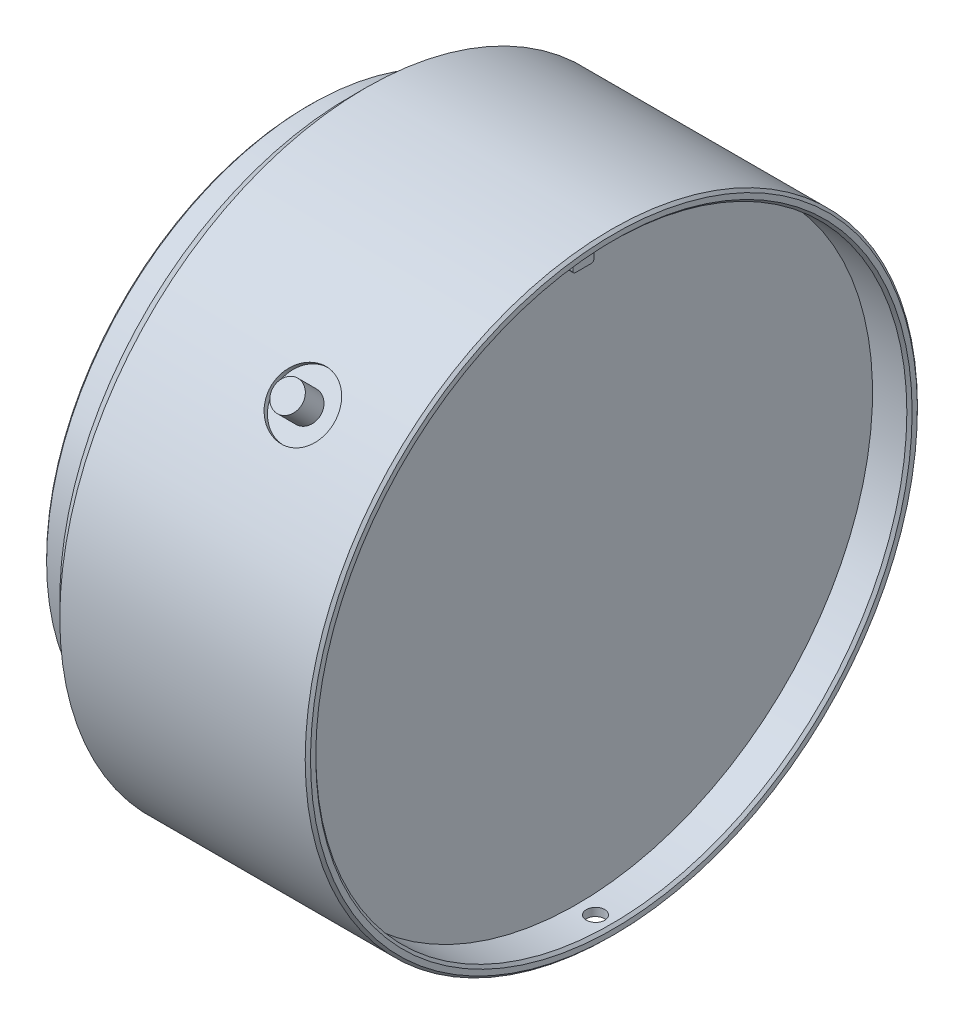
ISO-10303-21;
HEADER;
FILE_DESCRIPTION(('STEP AP214'),'2;1');
FILE_NAME('part.step','',(''),(''),'','','');
FILE_SCHEMA(('AUTOMOTIVE_DESIGN { 1 0 10303 214 1 1 1 1 }'));
ENDSEC;
DATA;
#1=APPLICATION_CONTEXT('core data for automotive mechanical design processes');
#2=APPLICATION_PROTOCOL_DEFINITION('international standard','automotive_design',2000,#1);
#3=PRODUCT_CONTEXT('',#1,'mechanical');
#4=PRODUCT('Part','Part','',(#3));
#5=PRODUCT_RELATED_PRODUCT_CATEGORY('part','',(#4));
#6=PRODUCT_DEFINITION_FORMATION('','',#4);
#7=PRODUCT_DEFINITION_CONTEXT('part definition',#1,'design');
#8=PRODUCT_DEFINITION('design','',#6,#7);
#9=PRODUCT_DEFINITION_SHAPE('','',#8);
#10=(LENGTH_UNIT() NAMED_UNIT(*) SI_UNIT(.MILLI.,.METRE.));
#11=(NAMED_UNIT(*) PLANE_ANGLE_UNIT() SI_UNIT($,.RADIAN.));
#12=(NAMED_UNIT(*) SI_UNIT($,.STERADIAN.) SOLID_ANGLE_UNIT());
#13=UNCERTAINTY_MEASURE_WITH_UNIT(LENGTH_MEASURE(1.E-05),#10,'distance_accuracy_value','');
#14=(GEOMETRIC_REPRESENTATION_CONTEXT(3) GLOBAL_UNCERTAINTY_ASSIGNED_CONTEXT((#13)) GLOBAL_UNIT_ASSIGNED_CONTEXT((#10,
#11,#12)) REPRESENTATION_CONTEXT('',''));
#15=CARTESIAN_POINT('',(0.,0.,0.));
#16=DIRECTION('',(0.,0.,1.));
#17=DIRECTION('',(1.,0.,0.));
#18=AXIS2_PLACEMENT_3D('',#15,#16,#17);
#19=CARTESIAN_POINT('',(6.,25.,0.));
#20=DIRECTION('',(1.,0.,0.));
#21=DIRECTION('',(0.,0.,-1.));
#22=AXIS2_PLACEMENT_3D('',#19,#20,#21);
#23=PLANE('',#22);
#24=CARTESIAN_POINT('',(6.,0.,0.));
#25=DIRECTION('',(-1.,0.,0.));
#26=DIRECTION('',(0.,0.,1.));
#27=AXIS2_PLACEMENT_3D('',#24,#25,#26);
#28=CIRCLE('',#27,25.);
#29=CARTESIAN_POINT('',(6.,0.,25.));
#30=VERTEX_POINT('',#29);
#31=EDGE_CURVE('E19',#30,#30,#28,.T.);
#32=ORIENTED_EDGE('',*,*,#31,.T.);
#33=EDGE_LOOP('',(#32));
#34=FACE_BOUND('',#33,.T.);
#35=ADVANCED_FACE('F16',(#34),#23,.F.);
#36=CARTESIAN_POINT('',(14.,40.,0.));
#37=DIRECTION('',(-1.,0.,0.));
#38=DIRECTION('',(0.,0.,1.));
#39=AXIS2_PLACEMENT_3D('',#36,#37,#38);
#40=PLANE('',#39);
#41=CARTESIAN_POINT('',(14.,40.,0.));
#42=DIRECTION('',(-1.,0.,0.));
#43=DIRECTION('',(0.,0.,1.));
#44=AXIS2_PLACEMENT_3D('',#41,#42,#43);
#45=CIRCLE('',#44,4.);
#46=CARTESIAN_POINT('',(14.,40.,4.));
#47=VERTEX_POINT('',#46);
#48=EDGE_CURVE('E139',#47,#47,#45,.T.);
#49=ORIENTED_EDGE('',*,*,#48,.T.);
#50=EDGE_LOOP('',(#49));
#51=FACE_BOUND('',#50,.T.);
#52=ADVANCED_FACE('F132',(#51),#40,.T.);
#53=CARTESIAN_POINT('',(20.2499999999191,-4.26741975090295E-13,-40.));
#54=DIRECTION('',(-1.,0.,0.));
#55=DIRECTION('',(0.,0.,1.));
#56=AXIS2_PLACEMENT_3D('',#53,#54,#55);
#57=CONICAL_SURFACE('',#56,3.40000000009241,1.02974425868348);
#58=CARTESIAN_POINT('',(22.2929261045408,-4.26741978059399E-13,-39.9999999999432));
#59=VERTEX_POINT('',#58);
#60=VERTEX_LOOP('',#59);
#61=FACE_BOUND('',#60,.T.);
#62=CARTESIAN_POINT('',(20.25,-4.26741975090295E-13,-40.));
#63=DIRECTION('',(-1.,0.,0.));
#64=DIRECTION('',(0.,0.,1.));
#65=AXIS2_PLACEMENT_3D('',#62,#63,#64);
#66=CIRCLE('',#65,3.39999999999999);
#67=CARTESIAN_POINT('',(20.25,-4.26741975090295E-13,-36.6));
#68=VERTEX_POINT('',#67);
#69=EDGE_CURVE('E136',#68,#68,#66,.T.);
#70=ORIENTED_EDGE('',*,*,#69,.T.);
#71=EDGE_LOOP('',(#70));
#72=FACE_BOUND('',#71,.T.);
#73=ADVANCED_FACE('F128',(#61,#72),#57,.F.);
#74=CARTESIAN_POINT('',(20.2499999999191,34.6410161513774,-20.0000000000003));
#75=DIRECTION('',(-1.,0.,0.));
#76=DIRECTION('',(0.,0.,1.));
#77=AXIS2_PLACEMENT_3D('',#74,#75,#76);
#78=CONICAL_SURFACE('',#77,3.40000000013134,1.02974425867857);
#79=CARTESIAN_POINT('',(22.2929261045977,34.6410161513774,-19.9999999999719));
#80=VERTEX_POINT('',#79);
#81=VERTEX_LOOP('',#80);
#82=FACE_BOUND('',#81,.T.);
#83=CARTESIAN_POINT('',(20.25,34.6410161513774,-20.0000000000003));
#84=DIRECTION('',(-1.,0.,0.));
#85=DIRECTION('',(0.,0.,1.));
#86=AXIS2_PLACEMENT_3D('',#83,#84,#85);
#87=CIRCLE('',#86,3.4);
#88=CARTESIAN_POINT('',(20.25,34.6410161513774,-16.6000000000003));
#89=VERTEX_POINT('',#88);
#90=EDGE_CURVE('E138',#89,#89,#87,.T.);
#91=ORIENTED_EDGE('',*,*,#90,.T.);
#92=EDGE_LOOP('',(#91));
#93=FACE_BOUND('',#92,.T.);
#94=ADVANCED_FACE('F131',(#82,#93),#78,.F.);
#95=CARTESIAN_POINT('',(20.2499999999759,34.6410161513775,20.));
#96=DIRECTION('',(-1.,0.,0.));
#97=DIRECTION('',(0.,0.,1.));
#98=AXIS2_PLACEMENT_3D('',#95,#96,#97);
#99=CONICAL_SURFACE('',#98,3.4000000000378,1.02974425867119);
#100=CARTESIAN_POINT('',(22.2929261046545,34.6410161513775,20.0000000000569));
#101=VERTEX_POINT('',#100);
#102=VERTEX_LOOP('',#101);
#103=FACE_BOUND('',#102,.T.);
#104=CARTESIAN_POINT('',(20.25,34.6410161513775,20.));
#105=DIRECTION('',(-1.,0.,0.));
#106=DIRECTION('',(0.,0.,1.));
#107=AXIS2_PLACEMENT_3D('',#104,#105,#106);
#108=CIRCLE('',#107,3.4);
#109=CARTESIAN_POINT('',(20.25,34.6410161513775,23.4));
#110=VERTEX_POINT('',#109);
#111=EDGE_CURVE('E142',#110,#110,#108,.T.);
#112=ORIENTED_EDGE('',*,*,#111,.T.);
#113=EDGE_LOOP('',(#112));
#114=FACE_BOUND('',#113,.T.);
#115=ADVANCED_FACE('F346',(#103,#114),#99,.F.);
#116=CARTESIAN_POINT('',(20.2499999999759,1.45716771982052E-13,40.));
#117=DIRECTION('',(-1.,0.,0.));
#118=DIRECTION('',(0.,0.,1.));
#119=AXIS2_PLACEMENT_3D('',#116,#117,#118);
#120=CONICAL_SURFACE('',#119,3.40000000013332,1.02974425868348);
#121=CARTESIAN_POINT('',(22.2929261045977,1.45716767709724E-13,40.0000000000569));
#122=VERTEX_POINT('',#121);
#123=VERTEX_LOOP('',#122);
#124=FACE_BOUND('',#123,.T.);
#125=CARTESIAN_POINT('',(20.25,1.45716771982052E-13,40.));
#126=DIRECTION('',(-1.,0.,0.));
#127=DIRECTION('',(0.,0.,1.));
#128=AXIS2_PLACEMENT_3D('',#125,#126,#127);
#129=CIRCLE('',#128,3.4);
#130=CARTESIAN_POINT('',(20.25,1.45716771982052E-13,43.4));
#131=VERTEX_POINT('',#130);
#132=EDGE_CURVE('E341',#131,#131,#129,.T.);
#133=ORIENTED_EDGE('',*,*,#132,.T.);
#134=EDGE_LOOP('',(#133));
#135=FACE_BOUND('',#134,.T.);
#136=ADVANCED_FACE('F446',(#124,#135),#120,.F.);
#137=CARTESIAN_POINT('',(20.2499999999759,-34.6410161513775,20.));
#138=DIRECTION('',(-1.,0.,0.));
#139=DIRECTION('',(0.,0.,1.));
#140=AXIS2_PLACEMENT_3D('',#137,#138,#139);
#141=CONICAL_SURFACE('',#140,3.40000000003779,1.02974425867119);
#142=CARTESIAN_POINT('',(22.2929261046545,-34.6410161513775,20.0000000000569));
#143=VERTEX_POINT('',#142);
#144=VERTEX_LOOP('',#143);
#145=FACE_BOUND('',#144,.T.);
#146=CARTESIAN_POINT('',(20.25,-34.6410161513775,20.));
#147=DIRECTION('',(-1.,0.,0.));
#148=DIRECTION('',(0.,0.,1.));
#149=AXIS2_PLACEMENT_3D('',#146,#147,#148);
#150=CIRCLE('',#149,3.4);
#151=CARTESIAN_POINT('',(20.25,-34.6410161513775,23.4));
#152=VERTEX_POINT('',#151);
#153=EDGE_CURVE('E338',#152,#152,#150,.T.);
#154=ORIENTED_EDGE('',*,*,#153,.T.);
#155=EDGE_LOOP('',(#154));
#156=FACE_BOUND('',#155,.T.);
#157=ADVANCED_FACE('F450',(#145,#156),#141,.F.);
#158=CARTESIAN_POINT('',(20.2499999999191,-34.6410161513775,-20.));
#159=DIRECTION('',(-1.,0.,0.));
#160=DIRECTION('',(0.,0.,1.));
#161=AXIS2_PLACEMENT_3D('',#158,#159,#160);
#162=CONICAL_SURFACE('',#161,3.40000000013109,1.02974425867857);
#163=CARTESIAN_POINT('',(22.2929261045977,-34.6410161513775,-19.9999999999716));
#164=VERTEX_POINT('',#163);
#165=VERTEX_LOOP('',#164);
#166=FACE_BOUND('',#165,.T.);
#167=CARTESIAN_POINT('',(20.25,-34.6410161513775,-20.));
#168=DIRECTION('',(-1.,0.,0.));
#169=DIRECTION('',(0.,0.,1.));
#170=AXIS2_PLACEMENT_3D('',#167,#168,#169);
#171=CIRCLE('',#170,3.4);
#172=CARTESIAN_POINT('',(20.25,-34.6410161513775,-16.6));
#173=VERTEX_POINT('',#172);
#174=EDGE_CURVE('E335',#173,#173,#171,.T.);
#175=ORIENTED_EDGE('',*,*,#174,.T.);
#176=EDGE_LOOP('',(#175));
#177=FACE_BOUND('',#176,.T.);
#178=ADVANCED_FACE('F454',(#166,#177),#162,.F.);
#179=CARTESIAN_POINT('',(0.,0.,0.));
#180=DIRECTION('',(-1.,0.,0.));
#181=DIRECTION('',(0.,0.,1.));
#182=AXIS2_PLACEMENT_3D('',#179,#180,#181);
#183=CYLINDRICAL_SURFACE('',#182,25.);
#184=CARTESIAN_POINT('',(0.499999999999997,0.,0.));
#185=DIRECTION('',(-1.,0.,0.));
#186=DIRECTION('',(0.,0.,1.));
#187=AXIS2_PLACEMENT_3D('',#184,#185,#186);
#188=CIRCLE('',#187,25.);
#189=CARTESIAN_POINT('',(0.499999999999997,0.,25.));
#190=VERTEX_POINT('',#189);
#191=EDGE_CURVE('E332',#190,#190,#188,.T.);
#192=ORIENTED_EDGE('',*,*,#191,.T.);
#193=EDGE_LOOP('',(#192));
#194=FACE_BOUND('',#193,.T.);
#195=ORIENTED_EDGE('',*,*,#31,.F.);
#196=EDGE_LOOP('',(#195));
#197=FACE_BOUND('',#196,.T.);
#198=ADVANCED_FACE('F431',(#194,#197),#183,.F.);
#199=CARTESIAN_POINT('',(14.,40.,0.));
#200=DIRECTION('',(-1.,0.,0.));
#201=DIRECTION('',(0.,0.,1.));
#202=AXIS2_PLACEMENT_3D('',#199,#200,#201);
#203=CYLINDRICAL_SURFACE('',#202,4.);
#204=CARTESIAN_POINT('',(0.50000000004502,40.,0.));
#205=DIRECTION('',(-1.,0.,0.));
#206=DIRECTION('',(0.,0.,1.));
#207=AXIS2_PLACEMENT_3D('',#204,#205,#206);
#208=CIRCLE('',#207,4.0000000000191);
#209=CARTESIAN_POINT('',(0.50000000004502,40.,4.0000000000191));
#210=VERTEX_POINT('',#209);
#211=EDGE_CURVE('E329',#210,#210,#208,.T.);
#212=ORIENTED_EDGE('',*,*,#211,.T.);
#213=EDGE_LOOP('',(#212));
#214=FACE_BOUND('',#213,.T.);
#215=ORIENTED_EDGE('',*,*,#48,.F.);
#216=EDGE_LOOP('',(#215));
#217=FACE_BOUND('',#216,.T.);
#218=ADVANCED_FACE('F427',(#214,#217),#203,.F.);
#219=CARTESIAN_POINT('',(0.,-4.26741975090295E-13,-40.));
#220=DIRECTION('',(-1.,0.,0.));
#221=DIRECTION('',(0.,0.,1.));
#222=AXIS2_PLACEMENT_3D('',#219,#220,#221);
#223=CYLINDRICAL_SURFACE('',#222,3.39999999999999);
#224=ORIENTED_EDGE('',*,*,#69,.F.);
#225=EDGE_LOOP('',(#224));
#226=FACE_BOUND('',#225,.T.);
#227=CARTESIAN_POINT('',(0.625000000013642,-4.26741975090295E-13,-40.));
#228=DIRECTION('',(-1.,0.,0.));
#229=DIRECTION('',(0.,0.,1.));
#230=AXIS2_PLACEMENT_3D('',#227,#228,#229);
#231=CIRCLE('',#230,3.39999999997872);
#232=CARTESIAN_POINT('',(0.625000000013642,-4.26741975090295E-13,-36.6000000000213));
#233=VERTEX_POINT('',#232);
#234=EDGE_CURVE('E326',#233,#233,#231,.T.);
#235=ORIENTED_EDGE('',*,*,#234,.T.);
#236=EDGE_LOOP('',(#235));
#237=FACE_BOUND('',#236,.T.);
#238=ADVANCED_FACE('F430',(#226,#237),#223,.F.);
#239=CARTESIAN_POINT('',(0.,34.6410161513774,-20.0000000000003));
#240=DIRECTION('',(-1.,0.,0.));
#241=DIRECTION('',(0.,0.,1.));
#242=AXIS2_PLACEMENT_3D('',#239,#240,#241);
#243=CYLINDRICAL_SURFACE('',#242,3.4);
#244=ORIENTED_EDGE('',*,*,#90,.F.);
#245=EDGE_LOOP('',(#244));
#246=FACE_BOUND('',#245,.T.);
#247=CARTESIAN_POINT('',(0.624999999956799,34.6410161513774,-20.0000000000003));
#248=DIRECTION('',(-1.,0.,0.));
#249=DIRECTION('',(0.,0.,1.));
#250=AXIS2_PLACEMENT_3D('',#247,#248,#249);
#251=CIRCLE('',#250,3.40000000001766);
#252=CARTESIAN_POINT('',(0.624999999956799,34.6410161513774,-16.5999999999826));
#253=VERTEX_POINT('',#252);
#254=EDGE_CURVE('E323',#253,#253,#251,.T.);
#255=ORIENTED_EDGE('',*,*,#254,.T.);
#256=EDGE_LOOP('',(#255));
#257=FACE_BOUND('',#256,.T.);
#258=ADVANCED_FACE('F352',(#246,#257),#243,.F.);
#259=CARTESIAN_POINT('',(0.,34.6410161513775,20.));
#260=DIRECTION('',(-1.,0.,0.));
#261=DIRECTION('',(0.,0.,1.));
#262=AXIS2_PLACEMENT_3D('',#259,#260,#261);
#263=CYLINDRICAL_SURFACE('',#262,3.4);
#264=ORIENTED_EDGE('',*,*,#111,.F.);
#265=EDGE_LOOP('',(#264));
#266=FACE_BOUND('',#265,.T.);
#267=CARTESIAN_POINT('',(0.625000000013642,34.6410161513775,20.));
#268=DIRECTION('',(-1.,0.,0.));
#269=DIRECTION('',(0.,0.,1.));
#270=AXIS2_PLACEMENT_3D('',#267,#268,#269);
#271=CIRCLE('',#270,3.39999999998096);
#272=CARTESIAN_POINT('',(0.625000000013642,34.6410161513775,23.399999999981));
#273=VERTEX_POINT('',#272);
#274=EDGE_CURVE('E320',#273,#273,#271,.T.);
#275=ORIENTED_EDGE('',*,*,#274,.T.);
#276=EDGE_LOOP('',(#275));
#277=FACE_BOUND('',#276,.T.);
#278=ADVANCED_FACE('F348',(#266,#277),#263,.F.);
#279=CARTESIAN_POINT('',(0.,1.45716771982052E-13,40.));
#280=DIRECTION('',(-1.,0.,0.));
#281=DIRECTION('',(0.,0.,1.));
#282=AXIS2_PLACEMENT_3D('',#279,#280,#281);
#283=CYLINDRICAL_SURFACE('',#282,3.4);
#284=ORIENTED_EDGE('',*,*,#132,.F.);
#285=EDGE_LOOP('',(#284));
#286=FACE_BOUND('',#285,.T.);
#287=CARTESIAN_POINT('',(0.625000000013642,1.45716771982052E-13,40.));
#288=DIRECTION('',(-1.,0.,0.));
#289=DIRECTION('',(0.,0.,1.));
#290=AXIS2_PLACEMENT_3D('',#287,#288,#289);
#291=CIRCLE('',#290,3.39999999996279);
#292=CARTESIAN_POINT('',(0.625000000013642,1.45716771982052E-13,43.3999999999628));
#293=VERTEX_POINT('',#292);
#294=EDGE_CURVE('E317',#293,#293,#291,.T.);
#295=ORIENTED_EDGE('',*,*,#294,.T.);
#296=EDGE_LOOP('',(#295));
#297=FACE_BOUND('',#296,.T.);
#298=ADVANCED_FACE('F351',(#286,#297),#283,.F.);
#299=CARTESIAN_POINT('',(0.,-34.6410161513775,20.));
#300=DIRECTION('',(-1.,0.,0.));
#301=DIRECTION('',(0.,0.,1.));
#302=AXIS2_PLACEMENT_3D('',#299,#300,#301);
#303=CYLINDRICAL_SURFACE('',#302,3.4);
#304=ORIENTED_EDGE('',*,*,#153,.F.);
#305=EDGE_LOOP('',(#304));
#306=FACE_BOUND('',#305,.T.);
#307=CARTESIAN_POINT('',(0.625000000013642,-34.6410161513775,20.));
#308=DIRECTION('',(-1.,0.,0.));
#309=DIRECTION('',(0.,0.,1.));
#310=AXIS2_PLACEMENT_3D('',#307,#308,#309);
#311=CIRCLE('',#310,3.39999999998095);
#312=CARTESIAN_POINT('',(0.625000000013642,-34.6410161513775,23.399999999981));
#313=VERTEX_POINT('',#312);
#314=EDGE_CURVE('E314',#313,#313,#311,.T.);
#315=ORIENTED_EDGE('',*,*,#314,.T.);
#316=EDGE_LOOP('',(#315));
#317=FACE_BOUND('',#316,.T.);
#318=ADVANCED_FACE('F468',(#306,#317),#303,.F.);
#319=CARTESIAN_POINT('',(0.,-34.6410161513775,-20.));
#320=DIRECTION('',(-1.,0.,0.));
#321=DIRECTION('',(0.,0.,1.));
#322=AXIS2_PLACEMENT_3D('',#319,#320,#321);
#323=CYLINDRICAL_SURFACE('',#322,3.4);
#324=ORIENTED_EDGE('',*,*,#174,.F.);
#325=EDGE_LOOP('',(#324));
#326=FACE_BOUND('',#325,.T.);
#327=CARTESIAN_POINT('',(0.624999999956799,-34.6410161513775,-20.));
#328=DIRECTION('',(-1.,0.,0.));
#329=DIRECTION('',(0.,0.,1.));
#330=AXIS2_PLACEMENT_3D('',#327,#328,#329);
#331=CIRCLE('',#330,3.40000000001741);
#332=CARTESIAN_POINT('',(0.624999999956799,-34.6410161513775,-16.5999999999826));
#333=VERTEX_POINT('',#332);
#334=EDGE_CURVE('E310',#333,#333,#331,.T.);
#335=ORIENTED_EDGE('',*,*,#334,.T.);
#336=EDGE_LOOP('',(#335));
#337=FACE_BOUND('',#336,.T.);
#338=ADVANCED_FACE('F472',(#326,#337),#323,.F.);
#339=CARTESIAN_POINT('',(0.,0.,0.));
#340=DIRECTION('',(-1.,0.,0.));
#341=DIRECTION('',(0.,0.,1.));
#342=AXIS2_PLACEMENT_3D('',#339,#340,#341);
#343=CONICAL_SURFACE('',#342,25.5,0.785398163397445);
#344=CARTESIAN_POINT('',(0.,0.,0.));
#345=DIRECTION('',(-1.,0.,0.));
#346=DIRECTION('',(0.,0.,1.));
#347=AXIS2_PLACEMENT_3D('',#344,#345,#346);
#348=CIRCLE('',#347,25.5);
#349=CARTESIAN_POINT('',(0.,0.,25.5));
#350=VERTEX_POINT('',#349);
#351=EDGE_CURVE('E313',#350,#350,#348,.T.);
#352=ORIENTED_EDGE('',*,*,#351,.T.);
#353=EDGE_LOOP('',(#352));
#354=FACE_BOUND('',#353,.T.);
#355=ORIENTED_EDGE('',*,*,#191,.F.);
#356=EDGE_LOOP('',(#355));
#357=FACE_BOUND('',#356,.T.);
#358=ADVANCED_FACE('F385',(#354,#357),#343,.F.);
#359=CARTESIAN_POINT('',(1.13686837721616E-10,40.,0.));
#360=DIRECTION('',(-1.,0.,0.));
#361=DIRECTION('',(0.,0.,1.));
#362=AXIS2_PLACEMENT_3D('',#359,#360,#361);
#363=CONICAL_SURFACE('',#362,4.49999999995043,0.785398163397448);
#364=CARTESIAN_POINT('',(5.6843418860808E-11,40.,0.));
#365=DIRECTION('',(-1.,0.,0.));
#366=DIRECTION('',(0.,0.,1.));
#367=AXIS2_PLACEMENT_3D('',#364,#365,#366);
#368=CIRCLE('',#367,4.50000000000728);
#369=CARTESIAN_POINT('',(5.6843418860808E-11,40.,4.50000000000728));
#370=VERTEX_POINT('',#369);
#371=EDGE_CURVE('E379',#370,#370,#368,.T.);
#372=ORIENTED_EDGE('',*,*,#371,.T.);
#373=EDGE_LOOP('',(#372));
#374=FACE_BOUND('',#373,.T.);
#375=ORIENTED_EDGE('',*,*,#211,.F.);
#376=EDGE_LOOP('',(#375));
#377=FACE_BOUND('',#376,.T.);
#378=ADVANCED_FACE('F420',(#374,#377),#363,.F.);
#379=CARTESIAN_POINT('',(1.70530256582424E-10,-4.26741975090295E-13,-40.));
#380=DIRECTION('',(-1.,0.,0.));
#381=DIRECTION('',(0.,0.,1.));
#382=AXIS2_PLACEMENT_3D('',#379,#380,#381);
#383=CONICAL_SURFACE('',#382,4.02499999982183,0.785398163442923);
#384=ORIENTED_EDGE('',*,*,#234,.F.);
#385=EDGE_LOOP('',(#384));
#386=FACE_BOUND('',#385,.T.);
#387=CARTESIAN_POINT('',(9.32240396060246E-11,-4.26741975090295E-13,-40.));
#388=DIRECTION('',(-1.,0.,0.));
#389=DIRECTION('',(0.,0.,1.));
#390=AXIS2_PLACEMENT_3D('',#387,#388,#389);
#391=CIRCLE('',#390,4.02499999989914);
#392=CARTESIAN_POINT('',(9.32240396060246E-11,-4.26741975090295E-13,-35.9750000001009));
#393=VERTEX_POINT('',#392);
#394=EDGE_CURVE('E373',#393,#393,#391,.T.);
#395=ORIENTED_EDGE('',*,*,#394,.T.);
#396=EDGE_LOOP('',(#395));
#397=FACE_BOUND('',#396,.T.);
#398=ADVANCED_FACE('F423',(#386,#397),#383,.F.);
#399=CARTESIAN_POINT('',(5.6843418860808E-11,34.6410161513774,-20.0000000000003));
#400=DIRECTION('',(-1.,0.,0.));
#401=DIRECTION('',(0.,0.,1.));
#402=AXIS2_PLACEMENT_3D('',#399,#400,#401);
#403=CONICAL_SURFACE('',#402,4.02499999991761,0.785398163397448);
#404=ORIENTED_EDGE('',*,*,#254,.F.);
#405=EDGE_LOOP('',(#404));
#406=FACE_BOUND('',#405,.T.);
#407=CARTESIAN_POINT('',(-9.5212032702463E-11,34.6410161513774,-20.0000000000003));
#408=DIRECTION('',(-1.,0.,0.));
#409=DIRECTION('',(0.,0.,1.));
#410=AXIS2_PLACEMENT_3D('',#407,#408,#409);
#411=CIRCLE('',#410,4.02500000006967);
#412=CARTESIAN_POINT('',(-9.5212032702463E-11,34.6410161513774,-15.9749999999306));
#413=VERTEX_POINT('',#412);
#414=EDGE_CURVE('E367',#413,#413,#411,.T.);
#415=ORIENTED_EDGE('',*,*,#414,.T.);
#416=EDGE_LOOP('',(#415));
#417=FACE_BOUND('',#416,.T.);
#418=ADVANCED_FACE('F360',(#406,#417),#403,.F.);
#419=CARTESIAN_POINT('',(1.13686837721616E-10,34.6410161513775,20.));
#420=DIRECTION('',(-1.,0.,0.));
#421=DIRECTION('',(0.,0.,1.));
#422=AXIS2_PLACEMENT_3D('',#419,#420,#421);
#423=CONICAL_SURFACE('',#422,4.02499999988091,0.785398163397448);
#424=ORIENTED_EDGE('',*,*,#274,.F.);
#425=EDGE_LOOP('',(#424));
#426=FACE_BOUND('',#425,.T.);
#427=CARTESIAN_POINT('',(3.86184140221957E-11,34.6410161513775,20.));
#428=DIRECTION('',(-1.,0.,0.));
#429=DIRECTION('',(0.,0.,1.));
#430=AXIS2_PLACEMENT_3D('',#427,#428,#429);
#431=CIRCLE('',#430,4.02499999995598);
#432=CARTESIAN_POINT('',(3.86184140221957E-11,34.6410161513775,24.024999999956));
#433=VERTEX_POINT('',#432);
#434=EDGE_CURVE('E364',#433,#433,#431,.T.);
#435=ORIENTED_EDGE('',*,*,#434,.T.);
#436=EDGE_LOOP('',(#435));
#437=FACE_BOUND('',#436,.T.);
#438=ADVANCED_FACE('F356',(#426,#437),#423,.F.);
#439=CARTESIAN_POINT('',(0.,1.45716771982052E-13,40.));
#440=DIRECTION('',(-1.,0.,0.));
#441=DIRECTION('',(0.,0.,1.));
#442=AXIS2_PLACEMENT_3D('',#439,#440,#441);
#443=CONICAL_SURFACE('',#442,4.02499999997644,0.785398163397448);
#444=ORIENTED_EDGE('',*,*,#294,.F.);
#445=EDGE_LOOP('',(#444));
#446=FACE_BOUND('',#445,.T.);
#447=CARTESIAN_POINT('',(-3.63875596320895E-11,1.45716771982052E-13,40.));
#448=DIRECTION('',(-1.,0.,0.));
#449=DIRECTION('',(0.,0.,1.));
#450=AXIS2_PLACEMENT_3D('',#447,#448,#449);
#451=CIRCLE('',#450,4.02500000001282);
#452=CARTESIAN_POINT('',(-3.63875596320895E-11,1.45716771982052E-13,44.0250000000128));
#453=VERTEX_POINT('',#452);
#454=EDGE_CURVE('E366',#453,#453,#451,.T.);
#455=ORIENTED_EDGE('',*,*,#454,.T.);
#456=EDGE_LOOP('',(#455));
#457=FACE_BOUND('',#456,.T.);
#458=ADVANCED_FACE('F359',(#446,#457),#443,.F.);
#459=CARTESIAN_POINT('',(1.13686837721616E-10,-34.6410161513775,20.));
#460=DIRECTION('',(-1.,0.,0.));
#461=DIRECTION('',(0.,0.,1.));
#462=AXIS2_PLACEMENT_3D('',#459,#460,#461);
#463=CONICAL_SURFACE('',#462,4.0249999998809,0.785398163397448);
#464=ORIENTED_EDGE('',*,*,#314,.F.);
#465=EDGE_LOOP('',(#464));
#466=FACE_BOUND('',#465,.T.);
#467=CARTESIAN_POINT('',(3.86080056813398E-11,-34.6410161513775,20.));
#468=DIRECTION('',(-1.,0.,0.));
#469=DIRECTION('',(0.,0.,1.));
#470=AXIS2_PLACEMENT_3D('',#467,#468,#469);
#471=CIRCLE('',#470,4.02499999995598);
#472=CARTESIAN_POINT('',(3.86080056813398E-11,-34.6410161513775,24.024999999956));
#473=VERTEX_POINT('',#472);
#474=EDGE_CURVE('E370',#473,#473,#471,.T.);
#475=ORIENTED_EDGE('',*,*,#474,.T.);
#476=EDGE_LOOP('',(#475));
#477=FACE_BOUND('',#476,.T.);
#478=ADVANCED_FACE('F409',(#466,#477),#463,.F.);
#479=CARTESIAN_POINT('',(5.6843418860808E-11,-34.6410161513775,-20.));
#480=DIRECTION('',(-1.,0.,0.));
#481=DIRECTION('',(0.,0.,1.));
#482=AXIS2_PLACEMENT_3D('',#479,#480,#481);
#483=CONICAL_SURFACE('',#482,4.02499999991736,0.785398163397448);
#484=ORIENTED_EDGE('',*,*,#334,.F.);
#485=EDGE_LOOP('',(#484));
#486=FACE_BOUND('',#485,.T.);
#487=CARTESIAN_POINT('',(-9.54618328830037E-11,-34.6410161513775,-20.));
#488=DIRECTION('',(-1.,0.,0.));
#489=DIRECTION('',(0.,0.,1.));
#490=AXIS2_PLACEMENT_3D('',#487,#488,#489);
#491=CIRCLE('',#490,4.02500000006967);
#492=CARTESIAN_POINT('',(-9.54618328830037E-11,-34.6410161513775,-15.9749999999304));
#493=VERTEX_POINT('',#492);
#494=EDGE_CURVE('E399',#493,#493,#491,.T.);
#495=ORIENTED_EDGE('',*,*,#494,.T.);
#496=EDGE_LOOP('',(#495));
#497=FACE_BOUND('',#496,.T.);
#498=ADVANCED_FACE('F392',(#486,#497),#483,.F.);
#499=CARTESIAN_POINT('',(0.,25.,0.));
#500=DIRECTION('',(1.,0.,0.));
#501=DIRECTION('',(0.,0.,-1.));
#502=AXIS2_PLACEMENT_3D('',#499,#500,#501);
#503=PLANE('',#502);
#504=ORIENTED_EDGE('',*,*,#494,.F.);
#505=EDGE_LOOP('',(#504));
#506=FACE_BOUND('',#505,.T.);
#507=ORIENTED_EDGE('',*,*,#474,.F.);
#508=EDGE_LOOP('',(#507));
#509=FACE_BOUND('',#508,.T.);
#510=ORIENTED_EDGE('',*,*,#454,.F.);
#511=EDGE_LOOP('',(#510));
#512=FACE_BOUND('',#511,.T.);
#513=ORIENTED_EDGE('',*,*,#434,.F.);
#514=EDGE_LOOP('',(#513));
#515=FACE_BOUND('',#514,.T.);
#516=ORIENTED_EDGE('',*,*,#414,.F.);
#517=EDGE_LOOP('',(#516));
#518=FACE_BOUND('',#517,.T.);
#519=ORIENTED_EDGE('',*,*,#394,.F.);
#520=EDGE_LOOP('',(#519));
#521=FACE_BOUND('',#520,.T.);
#522=ORIENTED_EDGE('',*,*,#371,.F.);
#523=EDGE_LOOP('',(#522));
#524=FACE_BOUND('',#523,.T.);
#525=ORIENTED_EDGE('',*,*,#351,.F.);
#526=EDGE_LOOP('',(#525));
#527=FACE_BOUND('',#526,.T.);
#528=CARTESIAN_POINT('',(0.,0.,0.));
#529=DIRECTION('',(1.,0.,0.));
#530=DIRECTION('',(0.,0.,-1.));
#531=AXIS2_PLACEMENT_3D('',#528,#529,#530);
#532=CIRCLE('',#531,49.5);
#533=CARTESIAN_POINT('',(0.,0.,-49.5));
#534=VERTEX_POINT('',#533);
#535=EDGE_CURVE('E397',#534,#534,#532,.T.);
#536=ORIENTED_EDGE('',*,*,#535,.F.);
#537=EDGE_LOOP('',(#536));
#538=FACE_BOUND('',#537,.T.);
#539=ADVANCED_FACE('F388',(#506,#509,#512,#515,#518,#521,#524,#527,#538),#503,.F.);
#540=CARTESIAN_POINT('',(40.,43.8406204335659,43.8406204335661));
#541=DIRECTION('',(0.,0.707106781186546,0.707106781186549));
#542=DIRECTION('',(0.,-0.707106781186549,0.707106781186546));
#543=AXIS2_PLACEMENT_3D('',#540,#541,#542);
#544=PLANE('',#543);
#545=CARTESIAN_POINT('',(40.,43.8406204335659,43.8406204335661));
#546=DIRECTION('',(0.,-0.707106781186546,-0.707106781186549));
#547=DIRECTION('',(0.,0.707106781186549,-0.707106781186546));
#548=AXIS2_PLACEMENT_3D('',#545,#546,#547);
#549=CIRCLE('',#548,2.75000000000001);
#550=CARTESIAN_POINT('',(40.,45.7851640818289,41.8960767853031));
#551=VERTEX_POINT('',#550);
#552=EDGE_CURVE('E309',#551,#551,#549,.T.);
#553=ORIENTED_EDGE('',*,*,#552,.F.);
#554=EDGE_LOOP('',(#553));
#555=FACE_BOUND('',#554,.T.);
#556=ADVANCED_FACE('F391',(#555),#544,.T.);
#557=CARTESIAN_POINT('',(0.500000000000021,0.,0.));
#558=DIRECTION('',(1.,0.,0.));
#559=DIRECTION('',(0.,0.,-1.));
#560=AXIS2_PLACEMENT_3D('',#557,#558,#559);
#561=CONICAL_SURFACE('',#560,50.,0.785398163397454);
#562=CARTESIAN_POINT('',(0.500000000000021,0.,0.));
#563=DIRECTION('',(-1.,0.,0.));
#564=DIRECTION('',(0.,0.,1.));
#565=AXIS2_PLACEMENT_3D('',#562,#563,#564);
#566=CIRCLE('',#565,50.);
#567=CARTESIAN_POINT('',(0.500000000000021,0.,50.));
#568=VERTEX_POINT('',#567);
#569=EDGE_CURVE('E305',#568,#568,#566,.F.);
#570=ORIENTED_EDGE('',*,*,#569,.F.);
#571=EDGE_LOOP('',(#570));
#572=FACE_BOUND('',#571,.T.);
#573=ORIENTED_EDGE('',*,*,#535,.T.);
#574=EDGE_LOOP('',(#573));
#575=FACE_BOUND('',#574,.T.);
#576=ADVANCED_FACE('F496',(#572,#575),#561,.T.);
#577=CARTESIAN_POINT('',(40.,43.8406204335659,43.8406204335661));
#578=DIRECTION('',(0.,-0.707106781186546,-0.707106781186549));
#579=DIRECTION('',(0.,0.707106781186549,-0.707106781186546));
#580=AXIS2_PLACEMENT_3D('',#577,#578,#579);
#581=CYLINDRICAL_SURFACE('',#580,2.75000000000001);
#582=ORIENTED_EDGE('',*,*,#552,.T.);
#583=EDGE_LOOP('',(#582));
#584=FACE_BOUND('',#583,.T.);
#585=CARTESIAN_POINT('',(40.,40.3050865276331,40.3050865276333));
#586=DIRECTION('',(0.,-0.707106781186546,-0.707106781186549));
#587=DIRECTION('',(0.,0.707106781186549,-0.707106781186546));
#588=AXIS2_PLACEMENT_3D('',#585,#586,#587);
#589=CIRCLE('',#588,2.75000000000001);
#590=CARTESIAN_POINT('',(40.,42.2496301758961,38.3605428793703));
#591=VERTEX_POINT('',#590);
#592=EDGE_CURVE('E308',#591,#591,#589,.F.);
#593=ORIENTED_EDGE('',*,*,#592,.T.);
#594=EDGE_LOOP('',(#593));
#595=FACE_BOUND('',#594,.T.);
#596=ADVANCED_FACE('F500',(#584,#595),#581,.T.);
#597=CARTESIAN_POINT('',(0.,0.,0.));
#598=DIRECTION('',(-1.,0.,0.));
#599=DIRECTION('',(0.,0.,1.));
#600=AXIS2_PLACEMENT_3D('',#597,#598,#599);
#601=CYLINDRICAL_SURFACE('',#600,50.);
#602=ORIENTED_EDGE('',*,*,#569,.T.);
#603=EDGE_LOOP('',(#602));
#604=FACE_BOUND('',#603,.T.);
#605=CARTESIAN_POINT('',(8.,0.,0.));
#606=DIRECTION('',(-1.,0.,0.));
#607=DIRECTION('',(0.,0.,1.));
#608=AXIS2_PLACEMENT_3D('',#605,#606,#607);
#609=CIRCLE('',#608,50.);
#610=CARTESIAN_POINT('',(8.,0.,50.));
#611=VERTEX_POINT('',#610);
#612=EDGE_CURVE('E992',#611,#611,#609,.T.);
#613=ORIENTED_EDGE('',*,*,#612,.T.);
#614=EDGE_LOOP('',(#613));
#615=FACE_BOUND('',#614,.T.);
#616=ADVANCED_FACE('F504',(#604,#615),#601,.T.);
#617=CARTESIAN_POINT('',(40.,40.3050865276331,40.3050865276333));
#618=DIRECTION('',(0.,-0.707106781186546,-0.707106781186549));
#619=DIRECTION('',(0.,0.707106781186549,-0.707106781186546));
#620=AXIS2_PLACEMENT_3D('',#617,#618,#619);
#621=PLANE('',#620);
#622=CARTESIAN_POINT('',(40.,40.3050865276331,40.3050865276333));
#623=DIRECTION('',(0.,-0.707106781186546,-0.707106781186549));
#624=DIRECTION('',(0.,0.707106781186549,-0.707106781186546));
#625=AXIS2_PLACEMENT_3D('',#622,#623,#624);
#626=CIRCLE('',#625,6.);
#627=CARTESIAN_POINT('',(40.,44.5477272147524,36.062445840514));
#628=VERTEX_POINT('',#627);
#629=EDGE_CURVE('E990',#628,#628,#626,.F.);
#630=ORIENTED_EDGE('',*,*,#629,.T.);
#631=EDGE_LOOP('',(#630));
#632=FACE_BOUND('',#631,.T.);
#633=ORIENTED_EDGE('',*,*,#592,.F.);
#634=EDGE_LOOP('',(#633));
#635=FACE_BOUND('',#634,.T.);
#636=ADVANCED_FACE('F508',(#632,#635),#621,.F.);
#637=CARTESIAN_POINT('',(8.,54.749959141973,0.));
#638=DIRECTION('',(1.,0.,0.));
#639=DIRECTION('',(0.,0.,-1.));
#640=AXIS2_PLACEMENT_3D('',#637,#638,#639);
#641=PLANE('',#640);
#642=ORIENTED_EDGE('',*,*,#612,.F.);
#643=EDGE_LOOP('',(#642));
#644=FACE_BOUND('',#643,.T.);
#645=CARTESIAN_POINT('',(8.,0.,0.));
#646=DIRECTION('',(1.,0.,0.));
#647=DIRECTION('',(0.,0.,-1.));
#648=AXIS2_PLACEMENT_3D('',#645,#646,#647);
#649=CIRCLE('',#648,55.);
#650=CARTESIAN_POINT('',(8.,0.,-55.));
#651=VERTEX_POINT('',#650);
#652=EDGE_CURVE('E531',#651,#651,#649,.T.);
#653=ORIENTED_EDGE('',*,*,#652,.F.);
#654=EDGE_LOOP('',(#653));
#655=FACE_BOUND('',#654,.T.);
#656=ADVANCED_FACE('F512',(#644,#655),#641,.F.);
#657=CARTESIAN_POINT('',(40.,47.3761543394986,47.3761543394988));
#658=DIRECTION('',(0.,-0.707106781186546,-0.707106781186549));
#659=DIRECTION('',(0.,0.707106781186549,-0.707106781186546));
#660=AXIS2_PLACEMENT_3D('',#657,#658,#659);
#661=CYLINDRICAL_SURFACE('',#660,6.);
#662=ORIENTED_EDGE('',*,*,#629,.F.);
#663=EDGE_LOOP('',(#662));
#664=FACE_BOUND('',#663,.T.);
#665=CARTESIAN_POINT('',(40.,36.5495154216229,45.0347967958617));
#666=CARTESIAN_POINT('',(39.8320496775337,36.5495162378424,45.0347963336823));
#667=CARTESIAN_POINT('',(39.6640715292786,36.555026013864,45.0303262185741));
#668=CARTESIAN_POINT('',(39.3292460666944,36.5770207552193,45.0124621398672));
#669=CARTESIAN_POINT('',(39.1623993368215,36.5935110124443,44.999063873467));
#670=CARTESIAN_POINT('',(38.8308103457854,36.6373536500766,44.9633752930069));
#671=CARTESIAN_POINT('',(38.6660720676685,36.6647241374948,44.9410701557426));
#672=CARTESIAN_POINT('',(38.3401011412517,36.7300847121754,44.8876670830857));
#673=CARTESIAN_POINT('',(38.1788698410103,36.7680788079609,44.856565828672));
#674=CARTESIAN_POINT('',(37.8613381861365,36.854272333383,44.7857757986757));
#675=CARTESIAN_POINT('',(37.7050313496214,36.9024576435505,44.7460989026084));
#676=CARTESIAN_POINT('',(37.3981602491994,37.0086468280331,44.6583117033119));
#677=CARTESIAN_POINT('',(37.2475981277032,37.0666543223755,44.6101982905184));
#678=CARTESIAN_POINT('',(36.9534517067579,37.1919051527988,44.5058291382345));
#679=CARTESIAN_POINT('',(36.8098618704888,37.259140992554,44.4495800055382));
#680=CARTESIAN_POINT('',(36.5304792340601,37.4023186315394,44.3291699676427));
#681=CARTESIAN_POINT('',(36.3946893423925,37.4782636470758,44.2650061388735));
#682=CARTESIAN_POINT('',(36.1314909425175,37.6384358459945,44.1288932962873));
#683=CARTESIAN_POINT('',(36.0041104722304,37.7226886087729,44.0569201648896));
#684=CARTESIAN_POINT('',(35.7590522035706,37.8985822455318,43.9057048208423));
#685=CARTESIAN_POINT('',(35.6413780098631,37.990225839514,43.82645993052));
#686=CARTESIAN_POINT('',(35.4166417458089,38.1800736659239,43.6611704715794));
#687=CARTESIAN_POINT('',(35.3095767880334,38.278276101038,43.5751277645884));
#688=CARTESIAN_POINT('',(35.1067397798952,38.4804843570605,43.3966647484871));
#689=CARTESIAN_POINT('',(35.0109719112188,38.5844923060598,43.3042420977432));
#690=CARTESIAN_POINT('',(34.8312871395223,38.7976253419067,43.1133942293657));
#691=CARTESIAN_POINT('',(34.7473926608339,38.9067596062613,43.0149581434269));
#692=CARTESIAN_POINT('',(34.5922408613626,39.129118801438,42.812786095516));
#693=CARTESIAN_POINT('',(34.5209882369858,39.2423452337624,42.7090481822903));
#694=CARTESIAN_POINT('',(34.3916998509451,39.4719097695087,42.4969730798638));
#695=CARTESIAN_POINT('',(34.3336587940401,39.588246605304,42.3886377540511));
#696=CARTESIAN_POINT('',(34.2311647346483,39.8231669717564,42.1680142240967));
#697=CARTESIAN_POINT('',(34.1867168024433,39.9417513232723,42.0557245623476));
#698=CARTESIAN_POINT('',(34.0746240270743,40.2985326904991,41.7149328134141));
#699=CARTESIAN_POINT('',(34.0276196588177,40.5388470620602,41.4815043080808));
#700=CARTESIAN_POINT('',(33.9905430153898,41.0175352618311,41.008231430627));
#701=CARTESIAN_POINT('',(34.0004692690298,41.2559091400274,40.768387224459));
#702=CARTESIAN_POINT('',(34.0575822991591,41.6063146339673,40.4096854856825));
#703=CARTESIAN_POINT('',(34.0835921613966,41.7217689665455,40.2904600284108));
#704=CARTESIAN_POINT('',(34.1494119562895,41.9497397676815,40.0530439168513));
#705=CARTESIAN_POINT('',(34.1892167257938,42.0622573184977,39.9348528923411));
#706=CARTESIAN_POINT('',(34.2823603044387,42.283667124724,39.7003467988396));
#707=CARTESIAN_POINT('',(34.3357043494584,42.3925579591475,39.5840324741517));
#708=CARTESIAN_POINT('',(34.4555110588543,42.6059522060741,39.3542552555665));
#709=CARTESIAN_POINT('',(34.5219689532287,42.7104571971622,39.2407913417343));
#710=CARTESIAN_POINT('',(34.6677062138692,42.9147140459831,39.0173075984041));
#711=CARTESIAN_POINT('',(34.7470144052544,43.0144545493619,38.9072961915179));
#712=CARTESIAN_POINT('',(34.9177478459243,43.2083030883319,38.6919052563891));
#713=CARTESIAN_POINT('',(35.0091686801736,43.3024131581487,38.5865240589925));
#714=CARTESIAN_POINT('',(35.2035342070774,43.4845311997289,38.3811723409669));
#715=CARTESIAN_POINT('',(35.3064824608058,43.5725372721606,38.2812035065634));
#716=CARTESIAN_POINT('',(35.5231174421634,43.7418977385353,38.0875691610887));
#717=CARTESIAN_POINT('',(35.6368002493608,43.8232545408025,37.993901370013));
#718=CARTESIAN_POINT('',(35.8747210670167,43.9792949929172,37.8131714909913));
#719=CARTESIAN_POINT('',(35.9990077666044,44.0539442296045,37.7261437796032));
#720=CARTESIAN_POINT('',(36.2567345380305,44.1957010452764,37.5599778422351));
#721=CARTESIAN_POINT('',(36.3901712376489,44.2628113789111,37.4808367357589));
#722=CARTESIAN_POINT('',(36.6654173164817,44.3892282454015,37.3310331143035));
#723=CARTESIAN_POINT('',(36.8072336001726,44.4485282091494,37.2603777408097));
#724=CARTESIAN_POINT('',(37.0980844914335,44.5589358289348,37.1282729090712));
#725=CARTESIAN_POINT('',(37.247116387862,44.6100465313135,37.06682002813));
#726=CARTESIAN_POINT('',(37.5516137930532,44.7039130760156,36.9535597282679));
#727=CARTESIAN_POINT('',(37.7070882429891,44.7466568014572,36.9017663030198));
#728=CARTESIAN_POINT('',(38.02310491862,44.8234694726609,36.8084262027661));
#729=CARTESIAN_POINT('',(38.1836451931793,44.8575417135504,36.7668756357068));
#730=CARTESIAN_POINT('',(38.5084217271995,44.916812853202,36.6944424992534));
#731=CARTESIAN_POINT('',(38.6726512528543,44.9420267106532,36.6635419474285));
#732=CARTESIAN_POINT('',(39.0038325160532,44.9835275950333,36.6126116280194));
#733=CARTESIAN_POINT('',(39.1707828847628,44.9998189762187,36.5925765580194));
#734=CARTESIAN_POINT('',(39.4483030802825,45.0193375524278,36.568557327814));
#735=CARTESIAN_POINT('',(39.5584356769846,45.02513334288,36.5614196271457));
#736=CARTESIAN_POINT('',(39.7790415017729,45.032863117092,36.5518984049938));
#737=CARTESIAN_POINT('',(39.8895147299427,45.0347970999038,36.5495148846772));
#738=CARTESIAN_POINT('',(40.1679503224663,45.0347963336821,36.5495162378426));
#739=CARTESIAN_POINT('',(40.3359284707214,45.0303262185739,36.5550260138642));
#740=CARTESIAN_POINT('',(40.6707539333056,45.012462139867,36.5770207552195));
#741=CARTESIAN_POINT('',(40.8376006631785,44.9990638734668,36.5935110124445));
#742=CARTESIAN_POINT('',(41.1691896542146,44.9633752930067,36.6373536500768));
#743=CARTESIAN_POINT('',(41.3339279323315,44.9410701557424,36.664724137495));
#744=CARTESIAN_POINT('',(41.6598988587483,44.8876670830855,36.7300847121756));
#745=CARTESIAN_POINT('',(41.8211301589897,44.8565658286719,36.7680788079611));
#746=CARTESIAN_POINT('',(42.1386618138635,44.7857757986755,36.8542723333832));
#747=CARTESIAN_POINT('',(42.2949686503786,44.7460989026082,36.9024576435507));
#748=CARTESIAN_POINT('',(42.6018397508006,44.6583117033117,37.0086468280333));
#749=CARTESIAN_POINT('',(42.7524018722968,44.6101982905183,37.0666543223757));
#750=CARTESIAN_POINT('',(43.0465482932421,44.5058291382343,37.191905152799));
#751=CARTESIAN_POINT('',(43.1901381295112,44.449580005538,37.2591409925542));
#752=CARTESIAN_POINT('',(43.4695207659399,44.3291699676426,37.4023186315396));
#753=CARTESIAN_POINT('',(43.6053106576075,44.2650061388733,37.478263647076));
#754=CARTESIAN_POINT('',(43.8685090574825,44.1288932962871,37.6384358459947));
#755=CARTESIAN_POINT('',(43.9958895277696,44.0569201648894,37.722688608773));
#756=CARTESIAN_POINT('',(44.2409477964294,43.9057048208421,37.898582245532));
#757=CARTESIAN_POINT('',(44.3586219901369,43.8264599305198,37.9902258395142));
#758=CARTESIAN_POINT('',(44.5833582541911,43.6611704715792,38.1800736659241));
#759=CARTESIAN_POINT('',(44.6904232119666,43.5751277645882,38.2782761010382));
#760=CARTESIAN_POINT('',(44.8932602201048,43.3966647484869,38.4804843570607));
#761=CARTESIAN_POINT('',(44.9890280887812,43.304242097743,38.58449230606));
#762=CARTESIAN_POINT('',(45.1687128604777,43.1133942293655,38.7976253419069));
#763=CARTESIAN_POINT('',(45.2526073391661,43.0149581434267,38.9067596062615));
#764=CARTESIAN_POINT('',(45.4077591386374,42.8127860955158,39.1291188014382));
#765=CARTESIAN_POINT('',(45.4790117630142,42.7090481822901,39.2423452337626));
#766=CARTESIAN_POINT('',(45.6083001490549,42.4969730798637,39.4719097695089));
#767=CARTESIAN_POINT('',(45.6663412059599,42.3886377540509,39.5882466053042));
#768=CARTESIAN_POINT('',(45.7688352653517,42.1680142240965,39.8231669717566));
#769=CARTESIAN_POINT('',(45.8132831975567,42.0557245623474,39.9417513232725));
#770=CARTESIAN_POINT('',(45.9253759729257,41.7149328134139,40.2985326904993));
#771=CARTESIAN_POINT('',(45.9723803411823,41.4815043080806,40.5388470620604));
#772=CARTESIAN_POINT('',(46.0094569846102,41.0082314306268,41.0175352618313));
#773=CARTESIAN_POINT('',(45.9995307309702,40.7683872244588,41.2559091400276));
#774=CARTESIAN_POINT('',(45.9424177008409,40.4096854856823,41.6063146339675));
#775=CARTESIAN_POINT('',(45.9164078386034,40.2904600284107,41.7217689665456));
#776=CARTESIAN_POINT('',(45.8505880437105,40.0530439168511,41.9497397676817));
#777=CARTESIAN_POINT('',(45.8107832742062,39.9348528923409,42.0622573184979));
#778=CARTESIAN_POINT('',(45.7176396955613,39.7003467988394,42.2836671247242));
#779=CARTESIAN_POINT('',(45.6642956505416,39.5840324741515,42.3925579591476));
#780=CARTESIAN_POINT('',(45.5444889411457,39.3542552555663,42.6059522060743));
#781=CARTESIAN_POINT('',(45.4780310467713,39.2407913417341,42.7104571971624));
#782=CARTESIAN_POINT('',(45.3322937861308,39.0173075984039,42.9147140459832));
#783=CARTESIAN_POINT('',(45.2529855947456,38.9072961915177,43.0144545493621));
#784=CARTESIAN_POINT('',(45.0822521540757,38.6919052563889,43.2083030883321));
#785=CARTESIAN_POINT('',(44.9908313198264,38.5865240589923,43.3024131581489));
#786=CARTESIAN_POINT('',(44.7964657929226,38.3811723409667,43.4845311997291));
#787=CARTESIAN_POINT('',(44.6935175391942,38.2812035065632,43.5725372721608));
#788=CARTESIAN_POINT('',(44.4768825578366,38.0875691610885,43.7418977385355));
#789=CARTESIAN_POINT('',(44.3631997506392,37.9939013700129,43.8232545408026));
#790=CARTESIAN_POINT('',(44.1252789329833,37.8131714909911,43.9792949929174));
#791=CARTESIAN_POINT('',(44.0009922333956,37.726143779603,44.0539442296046));
#792=CARTESIAN_POINT('',(43.7432654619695,37.5599778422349,44.1957010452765));
#793=CARTESIAN_POINT('',(43.6098287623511,37.4808367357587,44.2628113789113));
#794=CARTESIAN_POINT('',(43.3345826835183,37.3310331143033,44.3892282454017));
#795=CARTESIAN_POINT('',(43.1927663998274,37.2603777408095,44.4485282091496));
#796=CARTESIAN_POINT('',(42.9019155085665,37.128272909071,44.5589358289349));
#797=CARTESIAN_POINT('',(42.752883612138,37.0668200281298,44.6100465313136));
#798=CARTESIAN_POINT('',(42.4483862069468,36.9535597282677,44.7039130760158));
#799=CARTESIAN_POINT('',(42.2929117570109,36.9017663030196,44.7466568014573));
#800=CARTESIAN_POINT('',(41.97689508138,36.8084262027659,44.8234694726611));
#801=CARTESIAN_POINT('',(41.8163548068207,36.7668756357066,44.8575417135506));
#802=CARTESIAN_POINT('',(41.4915782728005,36.6944424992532,44.9168128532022));
#803=CARTESIAN_POINT('',(41.3273487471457,36.6635419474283,44.9420267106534));
#804=CARTESIAN_POINT('',(40.9961674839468,36.6126116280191,44.9835275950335));
#805=CARTESIAN_POINT('',(40.8292171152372,36.5925765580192,44.9998189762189));
#806=CARTESIAN_POINT('',(40.5516969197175,36.5685573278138,45.019337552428));
#807=CARTESIAN_POINT('',(40.4415643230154,36.5614196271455,45.0251333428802));
#808=CARTESIAN_POINT('',(40.2209584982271,36.5518984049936,45.0328631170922));
#809=CARTESIAN_POINT('',(40.1104852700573,36.549514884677,45.034797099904));
#810=CARTESIAN_POINT('',(40.,36.5495154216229,45.0347967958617));
#811=B_SPLINE_CURVE_WITH_KNOTS('',3,(#665,#666,#667,#668,#669,#670,#671,#672,#673,#674,#675,
#676,#677,#678,#679,#680,#681,#682,#683,#684,#685,#686,#687,#688,#689,#690,#691,#692,#693,#694,
#695,#696,#697,#698,#699,#700,#701,#702,#703,#704,#705,#706,#707,#708,#709,#710,#711,#712,#713,
#714,#715,#716,#717,#718,#719,#720,#721,#722,#723,#724,#725,#726,#727,#728,#729,#730,#731,#732,
#733,#734,#735,#736,#737,#738,#739,#740,#741,#742,#743,#744,#745,#746,#747,#748,#749,#750,#751,
#752,#753,#754,#755,#756,#757,#758,#759,#760,#761,#762,#763,#764,#765,#766,#767,#768,#769,#770,
#771,#772,#773,#774,#775,#776,#777,#778,#779,#780,#781,#782,#783,#784,#785,#786,#787,#788,#789,
#790,#791,#792,#793,#794,#795,#796,#797,#798,#799,#800,#801,#802,#803,#804,#805,#806,#807,#808,
#809,#810),.UNSPECIFIED.,.T.,.F.,(4,2,2,2,2,2,2,2,2,2,2,2,2,2,2,2,2,2,2,2,2,2,2,2,2,2,2,2,2,2,2,
2,2,2,2,2,2,2,2,2,2,2,2,2,2,2,2,2,2,2,2,2,2,2,2,2,2,2,2,2,2,2,2,2,2,2,2,2,2,2,2,2,4),(0.,
0.503749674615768,1.00774230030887,1.51257721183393,2.01760286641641,2.52193336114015,
3.02645013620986,3.53055948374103,4.03485560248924,4.54075603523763,5.04684350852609,
5.55279286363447,6.05892891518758,6.56600846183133,7.07327599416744,7.58033985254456,
8.08759261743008,9.09735418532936,10.1070896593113,10.6105649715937,11.113852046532,
11.6173340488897,12.1206332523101,12.6250774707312,13.1293383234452,13.6337553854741,
14.1379889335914,14.6446771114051,15.151179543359,15.6581052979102,16.1648420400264,
16.6723072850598,17.1795794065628,17.6859907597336,18.1921547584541,18.5235438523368,
18.8549330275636,19.3586827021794,19.8626753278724,20.3675102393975,20.87253589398,
21.3768663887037,21.8813831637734,22.3854925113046,22.8897886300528,23.3956890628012,
23.9017765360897,24.4077258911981,24.9138619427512,25.4209414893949,25.928209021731,
26.4352728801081,26.9425256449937,27.9522872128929,28.9620226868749,29.4654979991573,
29.9687850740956,30.4722670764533,30.9755662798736,31.4800104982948,31.9842713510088,
32.4886884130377,32.992921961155,33.4996101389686,34.0061125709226,34.5130383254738,
35.01977506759,35.5272403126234,36.0345124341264,36.5409237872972,37.0470877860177,
37.3784768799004,37.7098660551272),.UNSPECIFIED.);
#812=CARTESIAN_POINT('',(40.,36.5495154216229,45.0347967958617));
#813=VERTEX_POINT('',#812);
#814=EDGE_CURVE('E304',#813,#813,#811,.T.);
#815=ORIENTED_EDGE('',*,*,#814,.F.);
#816=EDGE_LOOP('',(#815));
#817=FACE_BOUND('',#816,.T.);
#818=ADVANCED_FACE('F516',(#664,#817),#661,.F.);
#819=CARTESIAN_POINT('',(11.,0.,0.));
#820=DIRECTION('',(1.,0.,0.));
#821=DIRECTION('',(0.,0.,-1.));
#822=AXIS2_PLACEMENT_3D('',#819,#820,#821);
#823=CONICAL_SURFACE('',#822,58.,0.785398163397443);
#824=ORIENTED_EDGE('',*,*,#652,.T.);
#825=EDGE_LOOP('',(#824));
#826=FACE_BOUND('',#825,.T.);
#827=CARTESIAN_POINT('',(11.,0.,0.));
#828=DIRECTION('',(-1.,0.,0.));
#829=DIRECTION('',(0.,0.,1.));
#830=AXIS2_PLACEMENT_3D('',#827,#828,#829);
#831=CIRCLE('',#830,58.);
#832=CARTESIAN_POINT('',(11.,0.,58.));
#833=VERTEX_POINT('',#832);
#834=EDGE_CURVE('E295',#833,#833,#831,.F.);
#835=ORIENTED_EDGE('',*,*,#834,.F.);
#836=EDGE_LOOP('',(#835));
#837=FACE_BOUND('',#836,.T.);
#838=ADVANCED_FACE('F521',(#826,#837),#823,.T.);
#839=CARTESIAN_POINT('',(0.,0.,0.));
#840=DIRECTION('',(-1.,0.,0.));
#841=DIRECTION('',(0.,0.,1.));
#842=AXIS2_PLACEMENT_3D('',#839,#840,#841);
#843=CYLINDRICAL_SURFACE('',#842,58.);
#844=DIRECTION('',(1.,0.,0.));
#845=VECTOR('',#844,1.);
#846=CARTESIAN_POINT('',(54.5,-57.8943002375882,3.49999999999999));
#847=LINE('',#846,#845);
#848=CARTESIAN_POINT('',(54.5,-57.8943002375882,3.49999999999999));
#849=VERTEX_POINT('',#848);
#850=CARTESIAN_POINT('',(57.5,-57.8943002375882,3.49999999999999));
#851=VERTEX_POINT('',#850);
#852=EDGE_CURVE('E294',#849,#851,#847,.T.);
#853=ORIENTED_EDGE('',*,*,#852,.T.);
#854=CARTESIAN_POINT('',(57.5,0.,0.));
#855=DIRECTION('',(-1.,0.,0.));
#856=DIRECTION('',(0.,0.,1.));
#857=AXIS2_PLACEMENT_3D('',#854,#855,#856);
#858=CIRCLE('',#857,58.);
#859=CARTESIAN_POINT('',(57.5,-57.8943002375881,-3.50000000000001));
#860=VERTEX_POINT('',#859);
#861=EDGE_CURVE('E284',#860,#851,#858,.F.);
#862=ORIENTED_EDGE('',*,*,#861,.F.);
#863=DIRECTION('',(-1.,0.,0.));
#864=VECTOR('',#863,1.);
#865=CARTESIAN_POINT('',(54.5,-57.8943002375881,-3.50000000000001));
#866=LINE('',#865,#864);
#867=CARTESIAN_POINT('',(54.5,-57.8943002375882,-3.50000000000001));
#868=VERTEX_POINT('',#867);
#869=EDGE_CURVE('E292',#860,#868,#866,.T.);
#870=ORIENTED_EDGE('',*,*,#869,.T.);
#871=CARTESIAN_POINT('',(54.5,-57.8943002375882,-3.50000000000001));
#872=CARTESIAN_POINT('',(54.4016545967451,-57.8942977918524,-3.50000953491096));
#873=CARTESIAN_POINT('',(54.3033137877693,-57.8945507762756,-3.49585497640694));
#874=CARTESIAN_POINT('',(54.1073374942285,-57.8955495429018,-3.47929148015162));
#875=CARTESIAN_POINT('',(54.0097019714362,-57.8962952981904,-3.46688299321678));
#876=CARTESIAN_POINT('',(53.8158968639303,-57.8982607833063,-3.43389826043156));
#877=CARTESIAN_POINT('',(53.7197261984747,-57.8994801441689,-3.41332837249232));
#878=CARTESIAN_POINT('',(53.5294862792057,-57.9023560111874,-3.36418909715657));
#879=CARTESIAN_POINT('',(53.4354170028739,-57.9040125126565,-3.33561979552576));
#880=CARTESIAN_POINT('',(53.1572770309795,-57.909573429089,-3.23814924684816));
#881=CARTESIAN_POINT('',(52.9771857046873,-57.9140702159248,-3.15747021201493));
#882=CARTESIAN_POINT('',(52.633233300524,-57.9241327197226,-2.96713105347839));
#883=CARTESIAN_POINT('',(52.46936949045,-57.9296982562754,-2.85747581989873));
#884=CARTESIAN_POINT('',(52.1621450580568,-57.941280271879,-2.61210687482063));
#885=CARTESIAN_POINT('',(52.0188083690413,-57.947297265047,-2.47636317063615));
#886=CARTESIAN_POINT('',(51.7569291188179,-57.9590999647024,-2.1827227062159));
#887=CARTESIAN_POINT('',(51.63839033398,-57.9648856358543,-2.02482257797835));
#888=CARTESIAN_POINT('',(51.4294082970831,-57.975577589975,-1.69122194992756));
#889=CARTESIAN_POINT('',(51.3389853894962,-57.9804832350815,-1.5155086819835));
#890=CARTESIAN_POINT('',(51.1889398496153,-57.9888564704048,-1.1513711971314));
#891=CARTESIAN_POINT('',(51.1293150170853,-57.9923241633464,-0.962947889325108));
#892=CARTESIAN_POINT('',(51.0426189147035,-57.9974274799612,-0.578970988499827));
#893=CARTESIAN_POINT('',(51.0155082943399,-57.999065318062,-0.383426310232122));
#894=CARTESIAN_POINT('',(50.9944887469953,-58.0003318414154,0.00944952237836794));
#895=CARTESIAN_POINT('',(51.0005802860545,-57.9999604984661,0.206780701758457));
#896=CARTESIAN_POINT('',(51.0457607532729,-57.9972522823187,0.5973505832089));
#897=CARTESIAN_POINT('',(51.0848063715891,-57.9949179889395,0.7905943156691));
#898=CARTESIAN_POINT('',(51.1947193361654,-57.9885496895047,1.16777880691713));
#899=CARTESIAN_POINT('',(51.2655867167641,-57.984515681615,1.35171955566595));
#900=CARTESIAN_POINT('',(51.4371822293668,-57.9751976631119,1.70522026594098));
#901=CARTESIAN_POINT('',(51.5379306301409,-57.9699128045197,1.87477036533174));
#902=CARTESIAN_POINT('',(51.7664088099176,-57.9586882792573,2.19456014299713));
#903=CARTESIAN_POINT('',(51.8941375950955,-57.9527486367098,2.34480053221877));
#904=CARTESIAN_POINT('',(52.1731745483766,-57.9408724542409,2.62194796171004));
#905=CARTESIAN_POINT('',(52.324516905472,-57.9349359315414,2.74882057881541));
#906=CARTESIAN_POINT('',(52.6464310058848,-57.9237420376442,2.97540332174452));
#907=CARTESIAN_POINT('',(52.8170087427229,-57.9184848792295,3.07510494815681));
#908=CARTESIAN_POINT('',(53.1725951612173,-57.9092427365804,3.24450860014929));
#909=CARTESIAN_POINT('',(53.3576132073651,-57.9052585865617,3.31419096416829));
#910=CARTESIAN_POINT('',(53.7366098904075,-57.8990245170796,3.42138731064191));
#911=CARTESIAN_POINT('',(53.9305744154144,-57.8967719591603,3.45895024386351));
#912=CARTESIAN_POINT('',(54.1882107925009,-57.8951059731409,3.48664859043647));
#913=CARTESIAN_POINT('',(54.2505179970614,-57.8948039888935,3.4916579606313));
#914=CARTESIAN_POINT('',(54.3752083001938,-57.8944013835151,3.49832910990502));
#915=CARTESIAN_POINT('',(54.4375911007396,-57.8943004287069,3.49999643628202));
#916=CARTESIAN_POINT('',(54.5,-57.8943002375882,3.49999999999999));
#917=B_SPLINE_CURVE_WITH_KNOTS('',3,(#871,#872,#873,#874,#875,#876,#877,#878,#879,#880,#881,
#882,#883,#884,#885,#886,#887,#888,#889,#890,#891,#892,#893,#894,#895,#896,#897,#898,#899,#900,
#901,#902,#903,#904,#905,#906,#907,#908,#909,#910,#911,#912,#913,#914,#915,#916),.UNSPECIFIED.,
.F.,.F.,(4,2,2,2,2,2,2,2,2,2,2,2,2,2,2,2,2,2,2,2,2,2,4),(0.,0.29493990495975,0.589863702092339,
0.884558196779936,1.17924953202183,1.76836625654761,2.35738362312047,2.94708225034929,
3.53687061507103,4.12708475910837,4.71725673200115,5.30671372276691,5.89617898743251,
6.48487075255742,7.07356315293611,7.6626557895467,8.25172673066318,8.84165861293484,
9.43177482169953,10.0222769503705,10.6118775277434,10.799341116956,10.9864932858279),.UNSPECIFIED.);
#918=EDGE_CURVE('E107',#868,#849,#917,.T.);
#919=ORIENTED_EDGE('',*,*,#918,.T.);
#920=EDGE_LOOP('',(#853,#862,#870,#919));
#921=FACE_BOUND('',#920,.T.);
#922=ORIENTED_EDGE('',*,*,#834,.T.);
#923=EDGE_LOOP('',(#922));
#924=FACE_BOUND('',#923,.T.);
#925=ORIENTED_EDGE('',*,*,#814,.T.);
#926=EDGE_LOOP('',(#925));
#927=FACE_BOUND('',#926,.T.);
#928=ADVANCED_FACE('F539',(#921,#924,#927),#843,.T.);
#929=CARTESIAN_POINT('',(54.5,-57.5,-3.50000000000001));
#930=DIRECTION('',(0.,0.,-1.));
#931=DIRECTION('',(-1.,0.,0.));
#932=AXIS2_PLACEMENT_3D('',#929,#930,#931);
#933=PLANE('',#932);
#934=CARTESIAN_POINT('',(57.8935767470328,-57.5,-3.50000000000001));
#935=CARTESIAN_POINT('',(57.8279810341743,-57.5657171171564,-3.50000000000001));
#936=CARTESIAN_POINT('',(57.7623851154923,-57.6314340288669,-3.50000000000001));
#937=CARTESIAN_POINT('',(57.6311928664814,-57.7628674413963,-3.50000000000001));
#938=CARTESIAN_POINT('',(57.5655965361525,-57.8285839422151,-3.50000000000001));
#939=CARTESIAN_POINT('',(57.5,-57.8943002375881,-3.50000000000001));
#940=B_SPLINE_CURVE_WITH_KNOTS('',3,(#934,#935,#936,#937,#938,#939),.UNSPECIFIED.,.F.,.F.,(4,2,
4),(0.,0.278556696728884,0.557113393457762),.UNSPECIFIED.);
#941=CARTESIAN_POINT('',(57.8935767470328,-57.5,-3.50000000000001));
#942=VERTEX_POINT('',#941);
#943=EDGE_CURVE('E297',#942,#860,#940,.T.);
#944=ORIENTED_EDGE('',*,*,#943,.F.);
#945=DIRECTION('',(1.,0.,0.));
#946=VECTOR('',#945,1.);
#947=CARTESIAN_POINT('',(54.5,-57.5,-3.50000000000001));
#948=LINE('',#947,#946);
#949=CARTESIAN_POINT('',(54.5,-57.5,-3.50000000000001));
#950=VERTEX_POINT('',#949);
#951=EDGE_CURVE('E281',#950,#942,#948,.T.);
#952=ORIENTED_EDGE('',*,*,#951,.F.);
#953=DIRECTION('',(0.,-1.,0.));
#954=VECTOR('',#953,1.);
#955=CARTESIAN_POINT('',(54.5,-57.5,-3.50000000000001));
#956=LINE('',#955,#954);
#957=EDGE_CURVE('E285',#950,#868,#956,.T.);
#958=ORIENTED_EDGE('',*,*,#957,.T.);
#959=ORIENTED_EDGE('',*,*,#869,.F.);
#960=EDGE_LOOP('',(#944,#952,#958,#959));
#961=FACE_BOUND('',#960,.T.);
#962=ADVANCED_FACE('F543',(#961),#933,.F.);
#963=CARTESIAN_POINT('',(54.5,-57.5,3.49999999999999));
#964=DIRECTION('',(0.,0.,1.));
#965=DIRECTION('',(1.,0.,0.));
#966=AXIS2_PLACEMENT_3D('',#963,#964,#965);
#967=PLANE('',#966);
#968=CARTESIAN_POINT('',(57.5,-57.8943002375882,3.49999999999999));
#969=CARTESIAN_POINT('',(57.5655965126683,-57.8285839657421,3.49999999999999));
#970=CARTESIAN_POINT('',(57.6311928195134,-57.7628674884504,3.49999999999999));
#971=CARTESIAN_POINT('',(57.7623850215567,-57.6314341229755,3.49999999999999));
#972=CARTESIAN_POINT('',(57.827980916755,-57.5657172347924,3.49999999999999));
#973=CARTESIAN_POINT('',(57.89357660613,-57.5000001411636,3.49999999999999));
#974=B_SPLINE_CURVE_WITH_KNOTS('',3,(#968,#969,#970,#971,#972,#973),.UNSPECIFIED.,.F.,.F.,(4,2,
4),(0.,0.27855659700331,0.557113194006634),.UNSPECIFIED.);
#975=CARTESIAN_POINT('',(57.8935766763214,-57.5000000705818,3.50000000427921));
#976=VERTEX_POINT('',#975);
#977=EDGE_CURVE('E288',#851,#976,#974,.T.);
#978=ORIENTED_EDGE('',*,*,#977,.F.);
#979=ORIENTED_EDGE('',*,*,#852,.F.);
#980=DIRECTION('',(0.,-1.,0.));
#981=VECTOR('',#980,1.);
#982=CARTESIAN_POINT('',(54.5,-57.5,3.49999999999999));
#983=LINE('',#982,#981);
#984=CARTESIAN_POINT('',(54.5,-57.5,3.49999999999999));
#985=VERTEX_POINT('',#984);
#986=EDGE_CURVE('E289',#849,#985,#983,.F.);
#987=ORIENTED_EDGE('',*,*,#986,.T.);
#988=DIRECTION('',(1.,0.,0.));
#989=VECTOR('',#988,1.);
#990=CARTESIAN_POINT('',(54.5,-57.5,3.49999999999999));
#991=LINE('',#990,#989);
#992=EDGE_CURVE('E277',#976,#985,#991,.F.);
#993=ORIENTED_EDGE('',*,*,#992,.F.);
#994=EDGE_LOOP('',(#978,#979,#987,#993));
#995=FACE_BOUND('',#994,.T.);
#996=ADVANCED_FACE('F549',(#995),#967,.F.);
#997=CARTESIAN_POINT('',(54.5,-57.5,0.));
#998=DIRECTION('',(0.,-1.,0.));
#999=DIRECTION('',(0.,0.,-1.));
#1000=AXIS2_PLACEMENT_3D('',#997,#998,#999);
#1001=CYLINDRICAL_SURFACE('',#1000,3.5);
#1002=CARTESIAN_POINT('',(54.5,-57.5,0.));
#1003=DIRECTION('',(0.,-1.,0.));
#1004=DIRECTION('',(0.,0.,-1.));
#1005=AXIS2_PLACEMENT_3D('',#1002,#1003,#1004);
#1006=CIRCLE('',#1005,3.5);
#1007=EDGE_CURVE('E279',#985,#950,#1006,.T.);
#1008=ORIENTED_EDGE('',*,*,#1007,.F.);
#1009=ORIENTED_EDGE('',*,*,#986,.F.);
#1010=ORIENTED_EDGE('',*,*,#918,.F.);
#1011=ORIENTED_EDGE('',*,*,#957,.F.);
#1012=EDGE_LOOP('',(#1008,#1009,#1010,#1011));
#1013=FACE_BOUND('',#1012,.T.);
#1014=ADVANCED_FACE('F575',(#1013),#1001,.F.);
#1015=CARTESIAN_POINT('',(57.5,0.,0.));
#1016=DIRECTION('',(-1.,0.,0.));
#1017=DIRECTION('',(0.,0.,1.));
#1018=AXIS2_PLACEMENT_3D('',#1015,#1016,#1017);
#1019=CONICAL_SURFACE('',#1018,58.,0.785398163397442);
#1020=ORIENTED_EDGE('',*,*,#943,.T.);
#1021=ORIENTED_EDGE('',*,*,#861,.T.);
#1022=ORIENTED_EDGE('',*,*,#977,.T.);
#1023=CARTESIAN_POINT('',(58.,-57.5,0.));
#1024=CARTESIAN_POINT('',(57.9999713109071,-57.5,0.583871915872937));
#1025=CARTESIAN_POINT('',(57.9910883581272,-57.5,1.16747460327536));
#1026=CARTESIAN_POINT('',(57.9556139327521,-57.5,2.33414127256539));
#1027=CARTESIAN_POINT('',(57.9290224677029,-57.5,2.91720525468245));
#1028=CARTESIAN_POINT('',(57.8935767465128,-57.5,3.50000000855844));
#1029=B_SPLINE_CURVE_WITH_KNOTS('',3,(#1023,#1024,#1025,#1026,#1027,#1028),.UNSPECIFIED.,.F.,
.F.,(4,2,4),(0.,1.75101086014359,3.50202097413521),.UNSPECIFIED.);
#1030=CARTESIAN_POINT('',(58.,-57.5,0.));
#1031=VERTEX_POINT('',#1030);
#1032=EDGE_CURVE('E280',#1031,#976,#1029,.T.);
#1033=ORIENTED_EDGE('',*,*,#1032,.F.);
#1034=CARTESIAN_POINT('',(58.,0.,0.));
#1035=DIRECTION('',(-1.,0.,0.));
#1036=DIRECTION('',(0.,0.,1.));
#1037=AXIS2_PLACEMENT_3D('',#1034,#1035,#1036);
#1038=CIRCLE('',#1037,57.5);
#1039=EDGE_CURVE('E590',#1031,#1031,#1038,.T.);
#1040=ORIENTED_EDGE('',*,*,#1039,.T.);
#1041=CARTESIAN_POINT('',(57.8935767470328,-57.5,-3.50000000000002));
#1042=CARTESIAN_POINT('',(57.9290224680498,-57.5,-2.91720524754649));
#1043=CARTESIAN_POINT('',(57.9556139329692,-57.5,-2.33414126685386));
#1044=CARTESIAN_POINT('',(57.991088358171,-57.5,-1.16747460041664));
#1045=CARTESIAN_POINT('',(57.9999713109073,-57.5,-0.583871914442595));
#1046=CARTESIAN_POINT('',(58.,-57.5,0.));
#1047=B_SPLINE_CURVE_WITH_KNOTS('',3,(#1041,#1042,#1043,#1044,#1045,#1046),.UNSPECIFIED.,.F.,
.F.,(4,2,4),(0.,1.75101010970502,3.50202096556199),.UNSPECIFIED.);
#1048=EDGE_CURVE('E283',#942,#1031,#1047,.T.);
#1049=ORIENTED_EDGE('',*,*,#1048,.F.);
#1050=EDGE_LOOP('',(#1020,#1021,#1022,#1033,#1040,#1049));
#1051=FACE_BOUND('',#1050,.T.);
#1052=ADVANCED_FACE('F571',(#1051),#1019,.T.);
#1053=CARTESIAN_POINT('',(54.5,-57.5,0.));
#1054=DIRECTION('',(0.,-1.,0.));
#1055=DIRECTION('',(0.,0.,-1.));
#1056=AXIS2_PLACEMENT_3D('',#1053,#1054,#1055);
#1057=PLANE('',#1056);
#1058=ORIENTED_EDGE('',*,*,#992,.T.);
#1059=ORIENTED_EDGE('',*,*,#1007,.T.);
#1060=ORIENTED_EDGE('',*,*,#951,.T.);
#1061=ORIENTED_EDGE('',*,*,#1048,.T.);
#1062=ORIENTED_EDGE('',*,*,#1032,.T.);
#1063=EDGE_LOOP('',(#1058,#1059,#1060,#1061,#1062));
#1064=FACE_BOUND('',#1063,.T.);
#1065=CARTESIAN_POINT('',(54.5,-57.5,0.));
#1066=DIRECTION('',(0.,-1.,0.));
#1067=DIRECTION('',(0.,0.,-1.));
#1068=AXIS2_PLACEMENT_3D('',#1065,#1066,#1067);
#1069=CIRCLE('',#1068,1.75);
#1070=CARTESIAN_POINT('',(54.5,-57.5,-1.75000000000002));
#1071=VERTEX_POINT('',#1070);
#1072=EDGE_CURVE('E592',#1071,#1071,#1069,.F.);
#1073=ORIENTED_EDGE('',*,*,#1072,.T.);
#1074=EDGE_LOOP('',(#1073));
#1075=FACE_BOUND('',#1074,.T.);
#1076=ADVANCED_FACE('F574',(#1064,#1075),#1057,.T.);
#1077=CARTESIAN_POINT('',(58.,58.,0.));
#1078=DIRECTION('',(-1.,0.,0.));
#1079=DIRECTION('',(0.,0.,1.));
#1080=AXIS2_PLACEMENT_3D('',#1077,#1078,#1079);
#1081=PLANE('',#1080);
#1082=ORIENTED_EDGE('',*,*,#1039,.F.);
#1083=EDGE_LOOP('',(#1082));
#1084=FACE_BOUND('',#1083,.T.);
#1085=CARTESIAN_POINT('',(58.,0.,0.));
#1086=DIRECTION('',(1.,0.,0.));
#1087=DIRECTION('',(0.,0.,-1.));
#1088=AXIS2_PLACEMENT_3D('',#1085,#1086,#1087);
#1089=CIRCLE('',#1088,56.5);
#1090=CARTESIAN_POINT('',(58.,0.,-56.5));
#1091=VERTEX_POINT('',#1090);
#1092=EDGE_CURVE('E187',#1091,#1091,#1089,.F.);
#1093=ORIENTED_EDGE('',*,*,#1092,.T.);
#1094=EDGE_LOOP('',(#1093));
#1095=FACE_BOUND('',#1094,.T.);
#1096=ADVANCED_FACE('F238',(#1084,#1095),#1081,.F.);
#1097=CARTESIAN_POINT('',(54.5,-52.5,0.));
#1098=DIRECTION('',(0.,-1.,0.));
#1099=DIRECTION('',(0.,0.,-1.));
#1100=AXIS2_PLACEMENT_3D('',#1097,#1098,#1099);
#1101=CYLINDRICAL_SURFACE('',#1100,1.75);
#1102=CARTESIAN_POINT('',(54.5,-55.9726495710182,1.74999999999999));
#1103=CARTESIAN_POINT('',(54.5981901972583,-55.9726499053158,1.74999592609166));
#1104=CARTESIAN_POINT('',(54.696512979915,-55.9729108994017,1.74170235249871));
#1105=CARTESIAN_POINT('',(54.8905109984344,-55.9739273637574,1.70871834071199));
#1106=CARTESIAN_POINT('',(54.9861801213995,-55.9746838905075,1.68399286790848));
#1107=CARTESIAN_POINT('',(55.1719402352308,-55.9766057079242,1.61884791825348));
#1108=CARTESIAN_POINT('',(55.2620358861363,-55.9777706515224,1.57844176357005));
#1109=CARTESIAN_POINT('',(55.4341173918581,-55.9803774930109,1.48310426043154));
#1110=CARTESIAN_POINT('',(55.5161070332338,-55.9818192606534,1.42817973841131));
#1111=CARTESIAN_POINT('',(55.6697474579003,-55.9848184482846,1.30532353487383));
#1112=CARTESIAN_POINT('',(55.741393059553,-55.9863759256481,1.23738537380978));
#1113=CARTESIAN_POINT('',(55.8722694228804,-55.9894305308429,1.09043945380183));
#1114=CARTESIAN_POINT('',(55.9314991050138,-55.9909276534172,1.01143073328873));
#1115=CARTESIAN_POINT('',(56.0358643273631,-55.9936929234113,0.844574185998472));
#1116=CARTESIAN_POINT('',(56.0809975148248,-55.994961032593,0.756724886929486));
#1117=CARTESIAN_POINT('',(56.1558726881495,-55.9971249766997,0.574692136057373));
#1118=CARTESIAN_POINT('',(56.1856148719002,-55.9980208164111,0.480508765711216));
#1119=CARTESIAN_POINT('',(56.2288551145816,-55.9993389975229,0.288513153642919));
#1120=CARTESIAN_POINT('',(56.2423584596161,-55.9997614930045,0.190702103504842));
#1121=CARTESIAN_POINT('',(56.2527539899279,-56.0000858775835,-0.0057995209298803));
#1122=CARTESIAN_POINT('',(56.2496462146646,-55.9999877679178,-0.104490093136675));
#1123=CARTESIAN_POINT('',(56.2269122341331,-55.999282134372,-0.299912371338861));
#1124=CARTESIAN_POINT('',(56.2072918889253,-55.9986747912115,-0.396644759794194));
#1125=CARTESIAN_POINT('',(56.1520984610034,-55.9970193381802,-0.585443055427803));
#1126=CARTESIAN_POINT('',(56.1165251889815,-55.9959712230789,-0.677508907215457));
#1127=CARTESIAN_POINT('',(56.030427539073,-55.9935519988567,-0.85438160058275));
#1128=CARTESIAN_POINT('',(55.9798999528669,-55.9921808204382,-0.939186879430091));
#1129=CARTESIAN_POINT('',(55.8653349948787,-55.9892701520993,-1.09910605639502));
#1130=CARTESIAN_POINT('',(55.8012987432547,-55.9877306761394,-1.17422075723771));
#1131=CARTESIAN_POINT('',(55.6615141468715,-55.9846563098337,-1.31265532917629));
#1132=CARTESIAN_POINT('',(55.5857630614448,-55.9831214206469,-1.37597243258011));
#1133=CARTESIAN_POINT('',(55.4246621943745,-55.9802288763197,-1.48902150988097));
#1134=CARTESIAN_POINT('',(55.3393078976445,-55.9788713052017,-1.53874705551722));
#1135=CARTESIAN_POINT('',(55.161400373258,-55.9764864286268,-1.62319454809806));
#1136=CARTESIAN_POINT('',(55.0688411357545,-55.9754594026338,-1.65790380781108));
#1137=CARTESIAN_POINT('',(54.8793339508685,-55.9738551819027,-1.71121538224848));
#1138=CARTESIAN_POINT('',(54.7823958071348,-55.9732770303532,-1.72985196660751));
#1139=CARTESIAN_POINT('',(54.654034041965,-55.9728530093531,-1.74348209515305));
#1140=CARTESIAN_POINT('',(54.6232815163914,-55.9727768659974,-1.74592459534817));
#1141=CARTESIAN_POINT('',(54.561690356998,-55.9726750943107,-1.74918418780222));
#1142=CARTESIAN_POINT('',(54.5308517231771,-55.9726494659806,-1.75000128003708));
#1143=CARTESIAN_POINT('',(54.4018098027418,-55.9726499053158,-1.74999592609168));
#1144=CARTESIAN_POINT('',(54.303487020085,-55.9729108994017,-1.74170235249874));
#1145=CARTESIAN_POINT('',(54.1094890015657,-55.9739273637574,-1.70871834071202));
#1146=CARTESIAN_POINT('',(54.0138198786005,-55.9746838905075,-1.68399286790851));
#1147=CARTESIAN_POINT('',(53.8280597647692,-55.9766057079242,-1.61884791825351));
#1148=CARTESIAN_POINT('',(53.7379641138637,-55.9777706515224,-1.57844176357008));
#1149=CARTESIAN_POINT('',(53.565882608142,-55.9803774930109,-1.48310426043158));
#1150=CARTESIAN_POINT('',(53.4838929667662,-55.9818192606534,-1.42817973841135));
#1151=CARTESIAN_POINT('',(53.3302525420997,-55.9848184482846,-1.30532353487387));
#1152=CARTESIAN_POINT('',(53.258606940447,-55.9863759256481,-1.23738537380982));
#1153=CARTESIAN_POINT('',(53.1277305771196,-55.9894305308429,-1.09043945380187));
#1154=CARTESIAN_POINT('',(53.0685008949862,-55.9909276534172,-1.01143073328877));
#1155=CARTESIAN_POINT('',(52.9641356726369,-55.9936929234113,-0.844574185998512));
#1156=CARTESIAN_POINT('',(52.9190024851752,-55.994961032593,-0.756724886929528));
#1157=CARTESIAN_POINT('',(52.8441273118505,-55.9971249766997,-0.574692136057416));
#1158=CARTESIAN_POINT('',(52.8143851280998,-55.9980208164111,-0.480508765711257));
#1159=CARTESIAN_POINT('',(52.7711448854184,-55.9993389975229,-0.288513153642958));
#1160=CARTESIAN_POINT('',(52.7576415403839,-55.9997614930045,-0.190702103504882));
#1161=CARTESIAN_POINT('',(52.7472460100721,-56.0000858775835,0.00579952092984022));
#1162=CARTESIAN_POINT('',(52.7503537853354,-55.9999877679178,0.104490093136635));
#1163=CARTESIAN_POINT('',(52.7730877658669,-55.999282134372,0.299912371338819));
#1164=CARTESIAN_POINT('',(52.7927081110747,-55.9986747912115,0.396644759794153));
#1165=CARTESIAN_POINT('',(52.8479015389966,-55.9970193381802,0.585443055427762));
#1166=CARTESIAN_POINT('',(52.8834748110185,-55.9959712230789,0.677508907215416));
#1167=CARTESIAN_POINT('',(52.969572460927,-55.9935519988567,0.854381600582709));
#1168=CARTESIAN_POINT('',(53.0201000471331,-55.9921808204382,0.93918687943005));
#1169=CARTESIAN_POINT('',(53.1346650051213,-55.9892701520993,1.09910605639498));
#1170=CARTESIAN_POINT('',(53.1987012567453,-55.9877306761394,1.17422075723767));
#1171=CARTESIAN_POINT('',(53.3384858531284,-55.9846563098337,1.31265532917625));
#1172=CARTESIAN_POINT('',(53.4142369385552,-55.9831214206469,1.37597243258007));
#1173=CARTESIAN_POINT('',(53.5753378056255,-55.9802288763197,1.48902150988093));
#1174=CARTESIAN_POINT('',(53.6606921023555,-55.9788713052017,1.53874705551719));
#1175=CARTESIAN_POINT('',(53.838599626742,-55.9764864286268,1.62319454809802));
#1176=CARTESIAN_POINT('',(53.9311588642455,-55.9754594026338,1.65790380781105));
#1177=CARTESIAN_POINT('',(54.1206660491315,-55.9738551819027,1.71121538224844));
#1178=CARTESIAN_POINT('',(54.2176041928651,-55.9732770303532,1.72985196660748));
#1179=CARTESIAN_POINT('',(54.345965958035,-55.9728530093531,1.74348209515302));
#1180=CARTESIAN_POINT('',(54.3767184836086,-55.9727768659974,1.74592459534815));
#1181=CARTESIAN_POINT('',(54.438309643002,-55.9726750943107,1.7491841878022));
#1182=CARTESIAN_POINT('',(54.4691482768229,-55.9726494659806,1.75000128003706));
#1183=CARTESIAN_POINT('',(54.5,-55.9726495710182,1.74999999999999));
#1184=B_SPLINE_CURVE_WITH_KNOTS('',3,(#1102,#1103,#1104,#1105,#1106,#1107,#1108,#1109,#1110,
#1111,#1112,#1113,#1114,#1115,#1116,#1117,#1118,#1119,#1120,#1121,#1122,#1123,#1124,#1125,#1126,
#1127,#1128,#1129,#1130,#1131,#1132,#1133,#1134,#1135,#1136,#1137,#1138,#1139,#1140,#1141,#1142,
#1143,#1144,#1145,#1146,#1147,#1148,#1149,#1150,#1151,#1152,#1153,#1154,#1155,#1156,#1157,#1158,
#1159,#1160,#1161,#1162,#1163,#1164,#1165,#1166,#1167,#1168,#1169,#1170,#1171,#1172,#1173,#1174,
#1175,#1176,#1177,#1178,#1179,#1180,#1181,#1182,#1183),.UNSPECIFIED.,.T.,.F.,(4,2,2,2,2,2,2,2,2,
2,2,2,2,2,2,2,2,2,2,2,2,2,2,2,2,2,2,2,2,2,2,2,2,2,2,2,2,2,2,2,4),(0.,0.294453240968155,
0.589536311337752,0.884369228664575,1.17906376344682,1.47390541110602,1.76877268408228,
2.0636891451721,2.35860181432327,2.65341845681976,2.94823439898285,3.24294575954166,
3.5376606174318,3.83243874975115,4.12719244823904,4.42201520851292,4.71697716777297,
5.01218785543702,5.30676753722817,5.39928583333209,5.49180413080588,5.78625737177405,
6.08134044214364,6.37617335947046,6.6708678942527,6.9657095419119,7.26057681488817,
7.55549327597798,7.85040594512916,8.14522258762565,8.44003852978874,8.73474989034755,
9.02946474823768,9.32424288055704,9.61899657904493,9.9138193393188,10.2087812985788,
10.5039919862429,10.7985716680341,10.891089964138,10.9836082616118),.UNSPECIFIED.);
#1185=CARTESIAN_POINT('',(54.5,-55.9726495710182,1.74999999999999));
#1186=VERTEX_POINT('',#1185);
#1187=EDGE_CURVE('E179',#1186,#1186,#1184,.T.);
#1188=ORIENTED_EDGE('',*,*,#1187,.T.);
#1189=EDGE_LOOP('',(#1188));
#1190=FACE_BOUND('',#1189,.T.);
#1191=ORIENTED_EDGE('',*,*,#1072,.F.);
#1192=EDGE_LOOP('',(#1191));
#1193=FACE_BOUND('',#1192,.T.);
#1194=ADVANCED_FACE('F189',(#1190,#1193),#1101,.F.);
#1195=CARTESIAN_POINT('',(52.2,0.,0.));
#1196=DIRECTION('',(-1.,0.,0.));
#1197=DIRECTION('',(0.,0.,1.));
#1198=AXIS2_PLACEMENT_3D('',#1195,#1196,#1197);
#1199=PLANE('',#1198);
#1200=CARTESIAN_POINT('',(52.2,49.5,-1.5));
#1201=DIRECTION('',(-1.,0.,0.));
#1202=DIRECTION('',(0.,0.,1.));
#1203=AXIS2_PLACEMENT_3D('',#1200,#1201,#1202);
#1204=CIRCLE('',#1203,0.5);
#1205=CARTESIAN_POINT('',(52.2,49.5,-2.));
#1206=VERTEX_POINT('',#1205);
#1207=CARTESIAN_POINT('',(52.2,49.,-1.5));
#1208=VERTEX_POINT('',#1207);
#1209=EDGE_CURVE('E168',#1206,#1208,#1204,.T.);
#1210=ORIENTED_EDGE('',*,*,#1209,.F.);
#1211=DIRECTION('',(0.,1.,0.));
#1212=VECTOR('',#1211,1.);
#1213=CARTESIAN_POINT('',(52.2,49.,-2.));
#1214=LINE('',#1213,#1212);
#1215=CARTESIAN_POINT('',(52.2,54.3874985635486,-2.));
#1216=VERTEX_POINT('',#1215);
#1217=EDGE_CURVE('E259',#1206,#1216,#1214,.T.);
#1218=ORIENTED_EDGE('',*,*,#1217,.T.);
#1219=CARTESIAN_POINT('',(52.2,54.3874985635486,-3.5));
#1220=DIRECTION('',(-1.,0.,0.));
#1221=DIRECTION('',(0.,0.,1.));
#1222=AXIS2_PLACEMENT_3D('',#1219,#1220,#1221);
#1223=CIRCLE('',#1222,1.5);
#1224=CARTESIAN_POINT('',(52.2,55.884402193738,-3.59633027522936));
#1225=VERTEX_POINT('',#1224);
#1226=EDGE_CURVE('E165',#1216,#1225,#1223,.T.);
#1227=ORIENTED_EDGE('',*,*,#1226,.T.);
#1228=CARTESIAN_POINT('',(52.2,0.,0.));
#1229=DIRECTION('',(-1.,0.,0.));
#1230=DIRECTION('',(0.,0.,1.));
#1231=AXIS2_PLACEMENT_3D('',#1228,#1229,#1230);
#1232=CIRCLE('',#1231,56.);
#1233=CARTESIAN_POINT('',(52.2,55.884402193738,3.59633027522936));
#1234=VERTEX_POINT('',#1233);
#1235=EDGE_CURVE('E160',#1225,#1234,#1232,.F.);
#1236=ORIENTED_EDGE('',*,*,#1235,.T.);
#1237=CARTESIAN_POINT('',(52.2,54.3874985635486,3.5));
#1238=DIRECTION('',(-1.,0.,0.));
#1239=DIRECTION('',(0.,0.,1.));
#1240=AXIS2_PLACEMENT_3D('',#1237,#1238,#1239);
#1241=CIRCLE('',#1240,1.5);
#1242=CARTESIAN_POINT('',(52.2,54.3874985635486,2.));
#1243=VERTEX_POINT('',#1242);
#1244=EDGE_CURVE('E176',#1234,#1243,#1241,.T.);
#1245=ORIENTED_EDGE('',*,*,#1244,.T.);
#1246=DIRECTION('',(0.,1.,0.));
#1247=VECTOR('',#1246,1.);
#1248=CARTESIAN_POINT('',(52.2,49.,2.));
#1249=LINE('',#1248,#1247);
#1250=CARTESIAN_POINT('',(52.2,49.5,2.));
#1251=VERTEX_POINT('',#1250);
#1252=EDGE_CURVE('E175',#1243,#1251,#1249,.F.);
#1253=ORIENTED_EDGE('',*,*,#1252,.T.);
#1254=CARTESIAN_POINT('',(52.2,49.5,1.5));
#1255=DIRECTION('',(-1.,0.,0.));
#1256=DIRECTION('',(0.,0.,1.));
#1257=AXIS2_PLACEMENT_3D('',#1254,#1255,#1256);
#1258=CIRCLE('',#1257,0.5);
#1259=CARTESIAN_POINT('',(52.2,49.,1.5));
#1260=VERTEX_POINT('',#1259);
#1261=EDGE_CURVE('E172',#1260,#1251,#1258,.T.);
#1262=ORIENTED_EDGE('',*,*,#1261,.F.);
#1263=DIRECTION('',(0.,0.,1.));
#1264=VECTOR('',#1263,1.);
#1265=CARTESIAN_POINT('',(52.2,49.,2.));
#1266=LINE('',#1265,#1264);
#1267=EDGE_CURVE('E171',#1260,#1208,#1266,.F.);
#1268=ORIENTED_EDGE('',*,*,#1267,.T.);
#1269=EDGE_LOOP('',(#1210,#1218,#1227,#1236,#1245,#1253,#1262,#1268));
#1270=FACE_BOUND('',#1269,.T.);
#1271=ADVANCED_FACE('F230',(#1270),#1199,.F.);
#1272=CARTESIAN_POINT('',(58.,0.,0.));
#1273=DIRECTION('',(1.,0.,0.));
#1274=DIRECTION('',(0.,0.,-1.));
#1275=AXIS2_PLACEMENT_3D('',#1272,#1273,#1274);
#1276=CONICAL_SURFACE('',#1275,56.5,0.785398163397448);
#1277=CARTESIAN_POINT('',(57.5,0.,0.));
#1278=DIRECTION('',(-1.,0.,0.));
#1279=DIRECTION('',(0.,0.,1.));
#1280=AXIS2_PLACEMENT_3D('',#1277,#1278,#1279);
#1281=CIRCLE('',#1280,56.);
#1282=CARTESIAN_POINT('',(57.5,0.,56.));
#1283=VERTEX_POINT('',#1282);
#1284=EDGE_CURVE('E159',#1283,#1283,#1281,.T.);
#1285=ORIENTED_EDGE('',*,*,#1284,.T.);
#1286=EDGE_LOOP('',(#1285));
#1287=FACE_BOUND('',#1286,.T.);
#1288=ORIENTED_EDGE('',*,*,#1092,.F.);
#1289=EDGE_LOOP('',(#1288));
#1290=FACE_BOUND('',#1289,.T.);
#1291=ADVANCED_FACE('F227',(#1287,#1290),#1276,.F.);
#1292=CARTESIAN_POINT('',(0.,54.3874985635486,3.5));
#1293=DIRECTION('',(-1.,0.,0.));
#1294=DIRECTION('',(0.,0.,1.));
#1295=AXIS2_PLACEMENT_3D('',#1292,#1293,#1294);
#1296=CYLINDRICAL_SURFACE('',#1295,1.5);
#1297=DIRECTION('',(-1.,0.,0.));
#1298=VECTOR('',#1297,1.);
#1299=CARTESIAN_POINT('',(0.,55.884402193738,3.59633027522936));
#1300=LINE('',#1299,#1298);
#1301=CARTESIAN_POINT('',(51.,55.884402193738,3.59633027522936));
#1302=VERTEX_POINT('',#1301);
#1303=EDGE_CURVE('E163',#1234,#1302,#1300,.T.);
#1304=ORIENTED_EDGE('',*,*,#1303,.T.);
#1305=CARTESIAN_POINT('',(51.,54.3874985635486,3.5));
#1306=DIRECTION('',(-1.,0.,0.));
#1307=DIRECTION('',(0.,0.,1.));
#1308=AXIS2_PLACEMENT_3D('',#1305,#1306,#1307);
#1309=CIRCLE('',#1308,1.5);
#1310=CARTESIAN_POINT('',(51.,54.3874985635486,2.));
#1311=VERTEX_POINT('',#1310);
#1312=EDGE_CURVE('E155',#1302,#1311,#1309,.T.);
#1313=ORIENTED_EDGE('',*,*,#1312,.T.);
#1314=DIRECTION('',(-1.,0.,0.));
#1315=VECTOR('',#1314,1.);
#1316=CARTESIAN_POINT('',(52.2,54.3874985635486,2.));
#1317=LINE('',#1316,#1315);
#1318=EDGE_CURVE('E178',#1311,#1243,#1317,.F.);
#1319=ORIENTED_EDGE('',*,*,#1318,.T.);
#1320=ORIENTED_EDGE('',*,*,#1244,.F.);
#1321=EDGE_LOOP('',(#1304,#1313,#1319,#1320));
#1322=FACE_BOUND('',#1321,.T.);
#1323=ADVANCED_FACE('F223',(#1322),#1296,.F.);
#1324=CARTESIAN_POINT('',(52.2,49.,2.));
#1325=DIRECTION('',(0.,0.,-1.));
#1326=DIRECTION('',(-1.,0.,0.));
#1327=AXIS2_PLACEMENT_3D('',#1324,#1325,#1326);
#1328=PLANE('',#1327);
#1329=DIRECTION('',(-1.,0.,0.));
#1330=VECTOR('',#1329,1.);
#1331=CARTESIAN_POINT('',(52.2,49.5,2.));
#1332=LINE('',#1331,#1330);
#1333=CARTESIAN_POINT('',(51.,49.5,2.));
#1334=VERTEX_POINT('',#1333);
#1335=EDGE_CURVE('E174',#1251,#1334,#1332,.T.);
#1336=ORIENTED_EDGE('',*,*,#1335,.F.);
#1337=ORIENTED_EDGE('',*,*,#1252,.F.);
#1338=ORIENTED_EDGE('',*,*,#1318,.F.);
#1339=DIRECTION('',(0.,1.,0.));
#1340=VECTOR('',#1339,1.);
#1341=CARTESIAN_POINT('',(51.,56.,2.));
#1342=LINE('',#1341,#1340);
#1343=EDGE_CURVE('E154',#1311,#1334,#1342,.F.);
#1344=ORIENTED_EDGE('',*,*,#1343,.T.);
#1345=EDGE_LOOP('',(#1336,#1337,#1338,#1344));
#1346=FACE_BOUND('',#1345,.T.);
#1347=ADVANCED_FACE('F219',(#1346),#1328,.F.);
#1348=CARTESIAN_POINT('',(52.2,49.5,1.5));
#1349=DIRECTION('',(-1.,0.,0.));
#1350=DIRECTION('',(0.,0.,1.));
#1351=AXIS2_PLACEMENT_3D('',#1348,#1349,#1350);
#1352=CYLINDRICAL_SURFACE('',#1351,0.5);
#1353=CARTESIAN_POINT('',(51.,49.5,1.5));
#1354=DIRECTION('',(-1.,0.,0.));
#1355=DIRECTION('',(0.,0.,1.));
#1356=AXIS2_PLACEMENT_3D('',#1353,#1354,#1355);
#1357=CIRCLE('',#1356,0.5);
#1358=CARTESIAN_POINT('',(51.,49.,1.5));
#1359=VERTEX_POINT('',#1358);
#1360=EDGE_CURVE('E151',#1334,#1359,#1357,.F.);
#1361=ORIENTED_EDGE('',*,*,#1360,.T.);
#1362=DIRECTION('',(1.,0.,0.));
#1363=VECTOR('',#1362,1.);
#1364=CARTESIAN_POINT('',(52.2,49.,1.5));
#1365=LINE('',#1364,#1363);
#1366=EDGE_CURVE('E262',#1359,#1260,#1365,.T.);
#1367=ORIENTED_EDGE('',*,*,#1366,.T.);
#1368=ORIENTED_EDGE('',*,*,#1261,.T.);
#1369=ORIENTED_EDGE('',*,*,#1335,.T.);
#1370=EDGE_LOOP('',(#1361,#1367,#1368,#1369));
#1371=FACE_BOUND('',#1370,.T.);
#1372=ADVANCED_FACE('F215',(#1371),#1352,.T.);
#1373=CARTESIAN_POINT('',(52.2,49.,2.));
#1374=DIRECTION('',(0.,1.,0.));
#1375=DIRECTION('',(0.,0.,1.));
#1376=AXIS2_PLACEMENT_3D('',#1373,#1374,#1375);
#1377=PLANE('',#1376);
#1378=DIRECTION('',(-1.,0.,0.));
#1379=VECTOR('',#1378,1.);
#1380=CARTESIAN_POINT('',(52.2,49.,-1.5));
#1381=LINE('',#1380,#1379);
#1382=CARTESIAN_POINT('',(51.,49.,-1.5));
#1383=VERTEX_POINT('',#1382);
#1384=EDGE_CURVE('E170',#1208,#1383,#1381,.T.);
#1385=ORIENTED_EDGE('',*,*,#1384,.F.);
#1386=ORIENTED_EDGE('',*,*,#1267,.F.);
#1387=ORIENTED_EDGE('',*,*,#1366,.F.);
#1388=DIRECTION('',(0.,0.,1.));
#1389=VECTOR('',#1388,1.);
#1390=CARTESIAN_POINT('',(51.,49.,0.));
#1391=LINE('',#1390,#1389);
#1392=EDGE_CURVE('E150',#1359,#1383,#1391,.F.);
#1393=ORIENTED_EDGE('',*,*,#1392,.T.);
#1394=EDGE_LOOP('',(#1385,#1386,#1387,#1393));
#1395=FACE_BOUND('',#1394,.T.);
#1396=ADVANCED_FACE('F211',(#1395),#1377,.F.);
#1397=CARTESIAN_POINT('',(52.2,49.5,-1.5));
#1398=DIRECTION('',(-1.,0.,0.));
#1399=DIRECTION('',(0.,0.,1.));
#1400=AXIS2_PLACEMENT_3D('',#1397,#1398,#1399);
#1401=CYLINDRICAL_SURFACE('',#1400,0.5);
#1402=CARTESIAN_POINT('',(51.,49.5,-1.5));
#1403=DIRECTION('',(-1.,0.,0.));
#1404=DIRECTION('',(0.,0.,1.));
#1405=AXIS2_PLACEMENT_3D('',#1402,#1403,#1404);
#1406=CIRCLE('',#1405,0.5);
#1407=CARTESIAN_POINT('',(51.,49.5,-2.));
#1408=VERTEX_POINT('',#1407);
#1409=EDGE_CURVE('E147',#1383,#1408,#1406,.F.);
#1410=ORIENTED_EDGE('',*,*,#1409,.T.);
#1411=DIRECTION('',(1.,0.,0.));
#1412=VECTOR('',#1411,1.);
#1413=CARTESIAN_POINT('',(52.2,49.5,-2.));
#1414=LINE('',#1413,#1412);
#1415=EDGE_CURVE('E250',#1408,#1206,#1414,.T.);
#1416=ORIENTED_EDGE('',*,*,#1415,.T.);
#1417=ORIENTED_EDGE('',*,*,#1209,.T.);
#1418=ORIENTED_EDGE('',*,*,#1384,.T.);
#1419=EDGE_LOOP('',(#1410,#1416,#1417,#1418));
#1420=FACE_BOUND('',#1419,.T.);
#1421=ADVANCED_FACE('F207',(#1420),#1401,.T.);
#1422=CARTESIAN_POINT('',(52.2,49.,-2.));
#1423=DIRECTION('',(0.,0.,1.));
#1424=DIRECTION('',(1.,0.,0.));
#1425=AXIS2_PLACEMENT_3D('',#1422,#1423,#1424);
#1426=PLANE('',#1425);
#1427=ORIENTED_EDGE('',*,*,#1415,.F.);
#1428=DIRECTION('',(0.,1.,0.));
#1429=VECTOR('',#1428,1.);
#1430=CARTESIAN_POINT('',(51.,56.,-2.));
#1431=LINE('',#1430,#1429);
#1432=CARTESIAN_POINT('',(51.,54.3874985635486,-2.));
#1433=VERTEX_POINT('',#1432);
#1434=EDGE_CURVE('E25',#1408,#1433,#1431,.T.);
#1435=ORIENTED_EDGE('',*,*,#1434,.T.);
#1436=DIRECTION('',(-1.,0.,0.));
#1437=VECTOR('',#1436,1.);
#1438=CARTESIAN_POINT('',(0.,54.3874985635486,-2.));
#1439=LINE('',#1438,#1437);
#1440=EDGE_CURVE('E167',#1433,#1216,#1439,.F.);
#1441=ORIENTED_EDGE('',*,*,#1440,.T.);
#1442=ORIENTED_EDGE('',*,*,#1217,.F.);
#1443=EDGE_LOOP('',(#1427,#1435,#1441,#1442));
#1444=FACE_BOUND('',#1443,.T.);
#1445=ADVANCED_FACE('F203',(#1444),#1426,.F.);
#1446=CARTESIAN_POINT('',(0.,54.3874985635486,-3.5));
#1447=DIRECTION('',(-1.,0.,0.));
#1448=DIRECTION('',(0.,0.,1.));
#1449=AXIS2_PLACEMENT_3D('',#1446,#1447,#1448);
#1450=CYLINDRICAL_SURFACE('',#1449,1.5);
#1451=DIRECTION('',(-1.,0.,0.));
#1452=VECTOR('',#1451,1.);
#1453=CARTESIAN_POINT('',(0.,55.884402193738,-3.59633027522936));
#1454=LINE('',#1453,#1452);
#1455=CARTESIAN_POINT('',(51.,55.884402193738,-3.59633027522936));
#1456=VERTEX_POINT('',#1455);
#1457=EDGE_CURVE('E164',#1456,#1225,#1454,.F.);
#1458=ORIENTED_EDGE('',*,*,#1457,.T.);
#1459=ORIENTED_EDGE('',*,*,#1226,.F.);
#1460=ORIENTED_EDGE('',*,*,#1440,.F.);
#1461=CARTESIAN_POINT('',(51.,54.3874985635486,-3.5));
#1462=DIRECTION('',(-1.,0.,0.));
#1463=DIRECTION('',(0.,0.,1.));
#1464=AXIS2_PLACEMENT_3D('',#1461,#1462,#1463);
#1465=CIRCLE('',#1464,1.5);
#1466=EDGE_CURVE('E11',#1433,#1456,#1465,.T.);
#1467=ORIENTED_EDGE('',*,*,#1466,.T.);
#1468=EDGE_LOOP('',(#1458,#1459,#1460,#1467));
#1469=FACE_BOUND('',#1468,.T.);
#1470=ADVANCED_FACE('F199',(#1469),#1450,.F.);
#1471=CARTESIAN_POINT('',(0.,0.,0.));
#1472=DIRECTION('',(-1.,0.,0.));
#1473=DIRECTION('',(0.,0.,1.));
#1474=AXIS2_PLACEMENT_3D('',#1471,#1472,#1473);
#1475=CYLINDRICAL_SURFACE('',#1474,56.);
#1476=ORIENTED_EDGE('',*,*,#1284,.F.);
#1477=EDGE_LOOP('',(#1476));
#1478=FACE_BOUND('',#1477,.T.);
#1479=CARTESIAN_POINT('',(51.,0.,0.));
#1480=DIRECTION('',(-1.,0.,0.));
#1481=DIRECTION('',(0.,0.,1.));
#1482=AXIS2_PLACEMENT_3D('',#1479,#1480,#1481);
#1483=CIRCLE('',#1482,56.);
#1484=EDGE_CURVE('E34',#1456,#1302,#1483,.T.);
#1485=ORIENTED_EDGE('',*,*,#1484,.T.);
#1486=ORIENTED_EDGE('',*,*,#1303,.F.);
#1487=ORIENTED_EDGE('',*,*,#1235,.F.);
#1488=ORIENTED_EDGE('',*,*,#1457,.F.);
#1489=EDGE_LOOP('',(#1485,#1486,#1487,#1488));
#1490=FACE_BOUND('',#1489,.T.);
#1491=ORIENTED_EDGE('',*,*,#1187,.F.);
#1492=EDGE_LOOP('',(#1491));
#1493=FACE_BOUND('',#1492,.T.);
#1494=ADVANCED_FACE('F193',(#1478,#1490,#1493),#1475,.F.);
#1495=CARTESIAN_POINT('',(51.,56.,0.));
#1496=DIRECTION('',(-1.,0.,0.));
#1497=DIRECTION('',(0.,0.,1.));
#1498=AXIS2_PLACEMENT_3D('',#1495,#1496,#1497);
#1499=PLANE('',#1498);
#1500=ORIENTED_EDGE('',*,*,#1466,.F.);
#1501=ORIENTED_EDGE('',*,*,#1434,.F.);
#1502=ORIENTED_EDGE('',*,*,#1409,.F.);
#1503=ORIENTED_EDGE('',*,*,#1392,.F.);
#1504=ORIENTED_EDGE('',*,*,#1360,.F.);
#1505=ORIENTED_EDGE('',*,*,#1343,.F.);
#1506=ORIENTED_EDGE('',*,*,#1312,.F.);
#1507=ORIENTED_EDGE('',*,*,#1484,.F.);
#1508=EDGE_LOOP('',(#1500,#1501,#1502,#1503,#1504,#1505,#1506,#1507));
#1509=FACE_BOUND('',#1508,.T.);
#1510=ADVANCED_FACE('F198',(#1509),#1499,.F.);
#1511=CLOSED_SHELL('',(#35,#52,#73,#94,#115,#136,#157,#178,#198,#218,#238,#258,#278,#298,#318,
#338,#358,#378,#398,#418,#438,#458,#478,#498,#539,#556,#576,#596,#616,#636,#656,#818,#838,#928,
#962,#996,#1014,#1052,#1076,#1096,#1194,#1271,#1291,#1323,#1347,#1372,#1396,#1421,#1445,#1470,
#1494,#1510));
#1512=MANIFOLD_SOLID_BREP('B1',#1511);
#1513=ADVANCED_BREP_SHAPE_REPRESENTATION('',(#18,#1512),#14);
#1514=SHAPE_DEFINITION_REPRESENTATION(#9,#1513);
ENDSEC;
END-ISO-10303-21;
